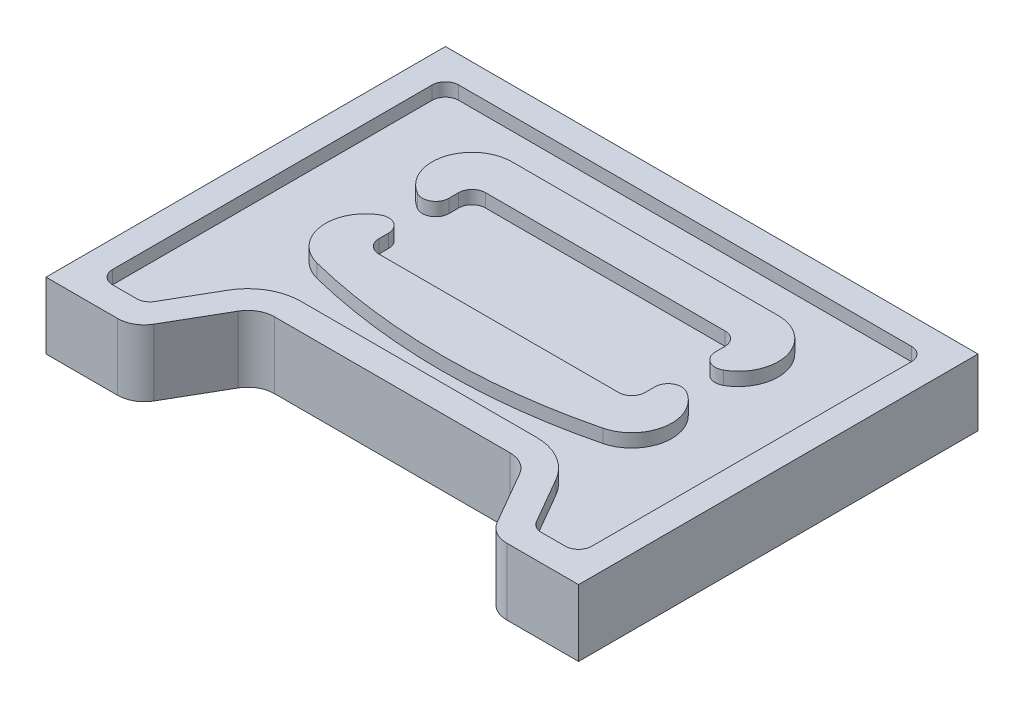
ISO-10303-21;
HEADER;
FILE_DESCRIPTION(('STEP AP214'),'2;1');
FILE_NAME('part.step','',(''),(''),'','','');
FILE_SCHEMA(('AUTOMOTIVE_DESIGN { 1 0 10303 214 1 1 1 1 }'));
ENDSEC;
DATA;
#1=APPLICATION_CONTEXT('core data for automotive mechanical design processes');
#2=APPLICATION_PROTOCOL_DEFINITION('international standard','automotive_design',2000,#1);
#3=PRODUCT_CONTEXT('',#1,'mechanical');
#4=PRODUCT('Part','Part','',(#3));
#5=PRODUCT_RELATED_PRODUCT_CATEGORY('part','',(#4));
#6=PRODUCT_DEFINITION_FORMATION('','',#4);
#7=PRODUCT_DEFINITION_CONTEXT('part definition',#1,'design');
#8=PRODUCT_DEFINITION('design','',#6,#7);
#9=PRODUCT_DEFINITION_SHAPE('','',#8);
#10=(LENGTH_UNIT() NAMED_UNIT(*) SI_UNIT(.MILLI.,.METRE.));
#11=(NAMED_UNIT(*) PLANE_ANGLE_UNIT() SI_UNIT($,.RADIAN.));
#12=(NAMED_UNIT(*) SI_UNIT($,.STERADIAN.) SOLID_ANGLE_UNIT());
#13=UNCERTAINTY_MEASURE_WITH_UNIT(LENGTH_MEASURE(1.E-05),#10,'distance_accuracy_value','');
#14=(GEOMETRIC_REPRESENTATION_CONTEXT(3) GLOBAL_UNCERTAINTY_ASSIGNED_CONTEXT((#13)) GLOBAL_UNIT_ASSIGNED_CONTEXT((#10,
#11,#12)) REPRESENTATION_CONTEXT('',''));
#15=CARTESIAN_POINT('',(0.,0.,0.));
#16=DIRECTION('',(0.,0.,1.));
#17=DIRECTION('',(1.,0.,0.));
#18=AXIS2_PLACEMENT_3D('',#15,#16,#17);
#19=CARTESIAN_POINT('',(75.9807621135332,20.,60.));
#20=DIRECTION('',(0.,1.,0.));
#21=DIRECTION('',(0.,0.,1.));
#22=AXIS2_PLACEMENT_3D('',#19,#20,#21);
#23=PLANE('',#22);
#24=DIRECTION('',(-1.,0.,0.));
#25=VECTOR('',#24,1.);
#26=CARTESIAN_POINT('',(-50.,20.,5.00000000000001));
#27=LINE('',#26,#25);
#28=CARTESIAN_POINT('',(45.,20.,5.));
#29=VERTEX_POINT('',#28);
#30=CARTESIAN_POINT('',(-45.,20.,5.00000000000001));
#31=VERTEX_POINT('',#30);
#32=EDGE_CURVE('E442',#29,#31,#27,.T.);
#33=ORIENTED_EDGE('',*,*,#32,.F.);
#34=CARTESIAN_POINT('',(45.,20.,0.));
#35=DIRECTION('',(0.,1.,0.));
#36=DIRECTION('',(0.,0.,1.));
#37=AXIS2_PLACEMENT_3D('',#34,#35,#36);
#38=CIRCLE('',#37,5.);
#39=CARTESIAN_POINT('',(50.,20.,0.));
#40=VERTEX_POINT('',#39);
#41=EDGE_CURVE('E751',#29,#40,#38,.T.);
#42=ORIENTED_EDGE('',*,*,#41,.T.);
#43=DIRECTION('',(0.,0.,1.));
#44=VECTOR('',#43,1.);
#45=CARTESIAN_POINT('',(50.,20.,5.));
#46=LINE('',#45,#44);
#47=CARTESIAN_POINT('',(50.,20.,-3.66025403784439));
#48=VERTEX_POINT('',#47);
#49=EDGE_CURVE('E439',#48,#40,#46,.T.);
#50=ORIENTED_EDGE('',*,*,#49,.F.);
#51=CARTESIAN_POINT('',(55.,20.,-3.66025403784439));
#52=DIRECTION('',(0.,1.,0.));
#53=DIRECTION('',(0.,0.,-1.));
#54=AXIS2_PLACEMENT_3D('',#51,#52,#53);
#55=CIRCLE('',#54,5.);
#56=CARTESIAN_POINT('',(57.5,20.,-7.99038105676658));
#57=VERTEX_POINT('',#56);
#58=EDGE_CURVE('E437',#57,#48,#55,.T.);
#59=ORIENTED_EDGE('',*,*,#58,.F.);
#60=CARTESIAN_POINT('',(50.,20.,5.));
#61=DIRECTION('',(0.,1.,0.));
#62=DIRECTION('',(0.,0.,1.));
#63=AXIS2_PLACEMENT_3D('',#60,#61,#62);
#64=CIRCLE('',#63,15.);
#65=CARTESIAN_POINT('',(53.636153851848,20.,19.5526075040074));
#66=VERTEX_POINT('',#65);
#67=EDGE_CURVE('E435',#66,#57,#64,.T.);
#68=ORIENTED_EDGE('',*,*,#67,.F.);
#69=CARTESIAN_POINT('',(0.,20.,-195.10989766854));
#70=DIRECTION('',(0.,1.,0.));
#71=DIRECTION('',(0.,0.,-1.));
#72=AXIS2_PLACEMENT_3D('',#69,#70,#71);
#73=CIRCLE('',#72,221.261899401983);
#74=CARTESIAN_POINT('',(-53.636153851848,20.,19.5526075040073));
#75=VERTEX_POINT('',#74);
#76=EDGE_CURVE('E408',#75,#66,#73,.T.);
#77=ORIENTED_EDGE('',*,*,#76,.F.);
#78=CARTESIAN_POINT('',(-50.,20.,5.00000000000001));
#79=DIRECTION('',(0.,1.,0.));
#80=DIRECTION('',(0.,0.,1.));
#81=AXIS2_PLACEMENT_3D('',#78,#79,#80);
#82=CIRCLE('',#81,15.);
#83=CARTESIAN_POINT('',(-57.5,20.,-7.99038105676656));
#84=VERTEX_POINT('',#83);
#85=EDGE_CURVE('E416',#84,#75,#82,.T.);
#86=ORIENTED_EDGE('',*,*,#85,.F.);
#87=CARTESIAN_POINT('',(-55.,20.,-3.66025403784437));
#88=DIRECTION('',(0.,1.,0.));
#89=DIRECTION('',(0.,0.,1.));
#90=AXIS2_PLACEMENT_3D('',#87,#88,#89);
#91=CIRCLE('',#90,5.);
#92=CARTESIAN_POINT('',(-50.,20.,-3.66025403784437));
#93=VERTEX_POINT('',#92);
#94=EDGE_CURVE('E447',#93,#84,#91,.T.);
#95=ORIENTED_EDGE('',*,*,#94,.F.);
#96=DIRECTION('',(0.,0.,-1.));
#97=VECTOR('',#96,1.);
#98=CARTESIAN_POINT('',(-50.,20.,5.00000000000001));
#99=LINE('',#98,#97);
#100=CARTESIAN_POINT('',(-50.,20.,0.));
#101=VERTEX_POINT('',#100);
#102=EDGE_CURVE('E445',#101,#93,#99,.T.);
#103=ORIENTED_EDGE('',*,*,#102,.F.);
#104=CARTESIAN_POINT('',(-45.,20.,0.));
#105=DIRECTION('',(0.,1.,0.));
#106=DIRECTION('',(0.,0.,1.));
#107=AXIS2_PLACEMENT_3D('',#104,#105,#106);
#108=CIRCLE('',#107,5.);
#109=EDGE_CURVE('E749',#101,#31,#108,.T.);
#110=ORIENTED_EDGE('',*,*,#109,.T.);
#111=EDGE_LOOP('',(#33,#42,#50,#59,#68,#77,#86,#95,#103,#110));
#112=FACE_BOUND('',#111,.T.);
#113=CARTESIAN_POINT('',(75.9807621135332,20.,60.));
#114=DIRECTION('',(0.,1.,0.));
#115=DIRECTION('',(0.,0.,1.));
#116=AXIS2_PLACEMENT_3D('',#113,#114,#115);
#117=CIRCLE('',#116,5.);
#118=CARTESIAN_POINT('',(71.650635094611,20.,62.5));
#119=VERTEX_POINT('',#118);
#120=CARTESIAN_POINT('',(75.9807621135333,20.,65.));
#121=VERTEX_POINT('',#120);
#122=EDGE_CURVE('E519',#119,#121,#117,.T.);
#123=ORIENTED_EDGE('',*,*,#122,.T.);
#124=DIRECTION('',(1.,0.,0.));
#125=VECTOR('',#124,1.);
#126=CARTESIAN_POINT('',(75.9807621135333,20.,65.));
#127=LINE('',#126,#125);
#128=CARTESIAN_POINT('',(85.,20.,65.));
#129=VERTEX_POINT('',#128);
#130=EDGE_CURVE('E522',#121,#129,#127,.T.);
#131=ORIENTED_EDGE('',*,*,#130,.T.);
#132=CARTESIAN_POINT('',(85.0000000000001,20.,60.));
#133=DIRECTION('',(0.,1.,0.));
#134=DIRECTION('',(0.,0.,-1.));
#135=AXIS2_PLACEMENT_3D('',#132,#133,#134);
#136=CIRCLE('',#135,5.);
#137=CARTESIAN_POINT('',(90.0000000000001,20.,60.));
#138=VERTEX_POINT('',#137);
#139=EDGE_CURVE('E526',#129,#138,#136,.T.);
#140=ORIENTED_EDGE('',*,*,#139,.T.);
#141=DIRECTION('',(0.,0.,-1.));
#142=VECTOR('',#141,1.);
#143=CARTESIAN_POINT('',(90.0000000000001,20.,60.));
#144=LINE('',#143,#142);
#145=CARTESIAN_POINT('',(90.0000000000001,20.,-60.));
#146=VERTEX_POINT('',#145);
#147=EDGE_CURVE('E529',#138,#146,#144,.T.);
#148=ORIENTED_EDGE('',*,*,#147,.T.);
#149=CARTESIAN_POINT('',(85.0000000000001,20.,-60.));
#150=DIRECTION('',(0.,1.,0.));
#151=DIRECTION('',(0.,0.,1.));
#152=AXIS2_PLACEMENT_3D('',#149,#150,#151);
#153=CIRCLE('',#152,5.);
#154=CARTESIAN_POINT('',(85.,20.,-65.));
#155=VERTEX_POINT('',#154);
#156=EDGE_CURVE('E532',#146,#155,#153,.T.);
#157=ORIENTED_EDGE('',*,*,#156,.T.);
#158=DIRECTION('',(-1.,0.,0.));
#159=VECTOR('',#158,1.);
#160=CARTESIAN_POINT('',(85.,20.,-65.));
#161=LINE('',#160,#159);
#162=CARTESIAN_POINT('',(-84.9999999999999,20.,-65.));
#163=VERTEX_POINT('',#162);
#164=EDGE_CURVE('E535',#155,#163,#161,.T.);
#165=ORIENTED_EDGE('',*,*,#164,.T.);
#166=CARTESIAN_POINT('',(-85.,20.,-60.));
#167=DIRECTION('',(0.,1.,0.));
#168=DIRECTION('',(0.,0.,1.));
#169=AXIS2_PLACEMENT_3D('',#166,#167,#168);
#170=CIRCLE('',#169,5.);
#171=CARTESIAN_POINT('',(-90.,20.,-60.));
#172=VERTEX_POINT('',#171);
#173=EDGE_CURVE('E538',#163,#172,#170,.T.);
#174=ORIENTED_EDGE('',*,*,#173,.T.);
#175=DIRECTION('',(0.,0.,1.));
#176=VECTOR('',#175,1.);
#177=CARTESIAN_POINT('',(-90.,20.,-60.));
#178=LINE('',#177,#176);
#179=CARTESIAN_POINT('',(-90.,20.,60.));
#180=VERTEX_POINT('',#179);
#181=EDGE_CURVE('E541',#172,#180,#178,.T.);
#182=ORIENTED_EDGE('',*,*,#181,.T.);
#183=CARTESIAN_POINT('',(-85.,20.,60.));
#184=DIRECTION('',(0.,1.,0.));
#185=DIRECTION('',(0.,0.,1.));
#186=AXIS2_PLACEMENT_3D('',#183,#184,#185);
#187=CIRCLE('',#186,5.);
#188=CARTESIAN_POINT('',(-84.9999999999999,20.,65.));
#189=VERTEX_POINT('',#188);
#190=EDGE_CURVE('E544',#180,#189,#187,.T.);
#191=ORIENTED_EDGE('',*,*,#190,.T.);
#192=DIRECTION('',(1.,0.,0.));
#193=VECTOR('',#192,1.);
#194=CARTESIAN_POINT('',(-84.9999999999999,20.,65.));
#195=LINE('',#194,#193);
#196=CARTESIAN_POINT('',(-75.980762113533,20.,65.));
#197=VERTEX_POINT('',#196);
#198=EDGE_CURVE('E547',#189,#197,#195,.T.);
#199=ORIENTED_EDGE('',*,*,#198,.T.);
#200=CARTESIAN_POINT('',(-75.980762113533,20.,60.));
#201=DIRECTION('',(0.,1.,0.));
#202=DIRECTION('',(0.,0.,1.));
#203=AXIS2_PLACEMENT_3D('',#200,#201,#202);
#204=CIRCLE('',#203,5.);
#205=CARTESIAN_POINT('',(-71.6506350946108,20.,62.5));
#206=VERTEX_POINT('',#205);
#207=EDGE_CURVE('E550',#197,#206,#204,.T.);
#208=ORIENTED_EDGE('',*,*,#207,.T.);
#209=DIRECTION('',(0.5,0.,-0.866025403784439));
#210=VECTOR('',#209,1.);
#211=CARTESIAN_POINT('',(-71.6506350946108,20.,62.5));
#212=LINE('',#211,#210);
#213=CARTESIAN_POINT('',(-61.5470053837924,20.,45.));
#214=VERTEX_POINT('',#213);
#215=EDGE_CURVE('E553',#206,#214,#212,.T.);
#216=ORIENTED_EDGE('',*,*,#215,.T.);
#217=CARTESIAN_POINT('',(-44.2264973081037,20.,55.));
#218=DIRECTION('',(0.,-1.,0.));
#219=DIRECTION('',(0.,0.,1.));
#220=AXIS2_PLACEMENT_3D('',#217,#218,#219);
#221=CIRCLE('',#220,19.9999999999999);
#222=CARTESIAN_POINT('',(-44.2264973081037,20.,35.));
#223=VERTEX_POINT('',#222);
#224=EDGE_CURVE('E556',#214,#223,#221,.T.);
#225=ORIENTED_EDGE('',*,*,#224,.T.);
#226=DIRECTION('',(1.,0.,0.));
#227=VECTOR('',#226,1.);
#228=CARTESIAN_POINT('',(-44.2264973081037,20.,35.));
#229=LINE('',#228,#227);
#230=CARTESIAN_POINT('',(44.2264973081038,20.,35.));
#231=VERTEX_POINT('',#230);
#232=EDGE_CURVE('E559',#223,#231,#229,.T.);
#233=ORIENTED_EDGE('',*,*,#232,.T.);
#234=CARTESIAN_POINT('',(44.2264973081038,20.,55.));
#235=DIRECTION('',(0.,-1.,0.));
#236=DIRECTION('',(0.,0.,1.));
#237=AXIS2_PLACEMENT_3D('',#234,#235,#236);
#238=CIRCLE('',#237,20.);
#239=CARTESIAN_POINT('',(61.5470053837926,20.,45.));
#240=VERTEX_POINT('',#239);
#241=EDGE_CURVE('E562',#231,#240,#238,.T.);
#242=ORIENTED_EDGE('',*,*,#241,.T.);
#243=DIRECTION('',(0.5,0.,0.866025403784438));
#244=VECTOR('',#243,1.);
#245=CARTESIAN_POINT('',(61.5470053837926,20.,45.));
#246=LINE('',#245,#244);
#247=EDGE_CURVE('E565',#240,#119,#246,.T.);
#248=ORIENTED_EDGE('',*,*,#247,.T.);
#249=EDGE_LOOP('',(#123,#131,#140,#148,#157,#165,#174,#182,#191,#199,#208,#216,#225,#233,#242,#248));
#250=FACE_BOUND('',#249,.T.);
#251=DIRECTION('',(1.,0.,0.));
#252=VECTOR('',#251,1.);
#253=CARTESIAN_POINT('',(-50.,20.,-35.));
#254=LINE('',#253,#252);
#255=CARTESIAN_POINT('',(-45.,20.,-35.));
#256=VERTEX_POINT('',#255);
#257=CARTESIAN_POINT('',(45.,20.,-35.));
#258=VERTEX_POINT('',#257);
#259=EDGE_CURVE('E492',#256,#258,#254,.T.);
#260=ORIENTED_EDGE('',*,*,#259,.F.);
#261=CARTESIAN_POINT('',(-45.,20.,-30.));
#262=DIRECTION('',(0.,1.,0.));
#263=DIRECTION('',(0.,0.,1.));
#264=AXIS2_PLACEMENT_3D('',#261,#262,#263);
#265=CIRCLE('',#264,5.);
#266=CARTESIAN_POINT('',(-50.,20.,-30.));
#267=VERTEX_POINT('',#266);
#268=EDGE_CURVE('E747',#256,#267,#265,.T.);
#269=ORIENTED_EDGE('',*,*,#268,.T.);
#270=DIRECTION('',(0.,0.,-1.));
#271=VECTOR('',#270,1.);
#272=CARTESIAN_POINT('',(-50.,20.,-26.3397459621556));
#273=LINE('',#272,#271);
#274=CARTESIAN_POINT('',(-50.,20.,-26.3397459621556));
#275=VERTEX_POINT('',#274);
#276=EDGE_CURVE('E490',#275,#267,#273,.T.);
#277=ORIENTED_EDGE('',*,*,#276,.F.);
#278=CARTESIAN_POINT('',(-55.,20.,-26.3397459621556));
#279=DIRECTION('',(0.,1.,0.));
#280=DIRECTION('',(0.,0.,-1.));
#281=AXIS2_PLACEMENT_3D('',#278,#279,#280);
#282=CIRCLE('',#281,5.);
#283=CARTESIAN_POINT('',(-57.5,20.,-22.0096189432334));
#284=VERTEX_POINT('',#283);
#285=EDGE_CURVE('E488',#284,#275,#282,.T.);
#286=ORIENTED_EDGE('',*,*,#285,.F.);
#287=CARTESIAN_POINT('',(-50.,20.,-35.));
#288=DIRECTION('',(0.,1.,0.));
#289=DIRECTION('',(0.,0.,1.));
#290=AXIS2_PLACEMENT_3D('',#287,#288,#289);
#291=CIRCLE('',#290,15.);
#292=CARTESIAN_POINT('',(-50.,20.,-50.));
#293=VERTEX_POINT('',#292);
#294=EDGE_CURVE('E466',#293,#284,#291,.T.);
#295=ORIENTED_EDGE('',*,*,#294,.F.);
#296=DIRECTION('',(-1.,0.,0.));
#297=VECTOR('',#296,1.);
#298=CARTESIAN_POINT('',(-50.,20.,-50.));
#299=LINE('',#298,#297);
#300=CARTESIAN_POINT('',(50.,20.,-50.));
#301=VERTEX_POINT('',#300);
#302=EDGE_CURVE('E471',#301,#293,#299,.T.);
#303=ORIENTED_EDGE('',*,*,#302,.F.);
#304=CARTESIAN_POINT('',(50.,20.,-35.));
#305=DIRECTION('',(0.,1.,0.));
#306=DIRECTION('',(0.,0.,1.));
#307=AXIS2_PLACEMENT_3D('',#304,#305,#306);
#308=CIRCLE('',#307,15.);
#309=CARTESIAN_POINT('',(57.5,20.,-22.0096189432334));
#310=VERTEX_POINT('',#309);
#311=EDGE_CURVE('E499',#310,#301,#308,.T.);
#312=ORIENTED_EDGE('',*,*,#311,.F.);
#313=CARTESIAN_POINT('',(55.,20.,-26.3397459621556));
#314=DIRECTION('',(0.,1.,0.));
#315=DIRECTION('',(0.,0.,1.));
#316=AXIS2_PLACEMENT_3D('',#313,#314,#315);
#317=CIRCLE('',#316,5.);
#318=CARTESIAN_POINT('',(50.,20.,-26.3397459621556));
#319=VERTEX_POINT('',#318);
#320=EDGE_CURVE('E497',#319,#310,#317,.T.);
#321=ORIENTED_EDGE('',*,*,#320,.F.);
#322=DIRECTION('',(0.,0.,1.));
#323=VECTOR('',#322,1.);
#324=CARTESIAN_POINT('',(50.,20.,-26.3397459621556));
#325=LINE('',#324,#323);
#326=CARTESIAN_POINT('',(50.,20.,-30.));
#327=VERTEX_POINT('',#326);
#328=EDGE_CURVE('E495',#327,#319,#325,.T.);
#329=ORIENTED_EDGE('',*,*,#328,.F.);
#330=CARTESIAN_POINT('',(45.,20.,-30.));
#331=DIRECTION('',(0.,1.,0.));
#332=DIRECTION('',(0.,0.,1.));
#333=AXIS2_PLACEMENT_3D('',#330,#331,#332);
#334=CIRCLE('',#333,5.);
#335=EDGE_CURVE('E745',#327,#258,#334,.T.);
#336=ORIENTED_EDGE('',*,*,#335,.T.);
#337=EDGE_LOOP('',(#260,#269,#277,#286,#295,#303,#312,#321,#329,#336));
#338=FACE_BOUND('',#337,.T.);
#339=ADVANCED_FACE('F39',(#112,#250,#338),#23,.T.);
#340=CARTESIAN_POINT('',(100.,25.,75.));
#341=DIRECTION('',(-1.,0.,0.));
#342=DIRECTION('',(0.,0.,1.));
#343=AXIS2_PLACEMENT_3D('',#340,#341,#342);
#344=PLANE('',#343);
#345=DIRECTION('',(0.,0.,-1.));
#346=VECTOR('',#345,1.);
#347=CARTESIAN_POINT('',(100.,0.,75.));
#348=LINE('',#347,#346);
#349=CARTESIAN_POINT('',(100.,0.,75.));
#350=VERTEX_POINT('',#349);
#351=CARTESIAN_POINT('',(100.,0.,-75.));
#352=VERTEX_POINT('',#351);
#353=EDGE_CURVE('E616',#350,#352,#348,.T.);
#354=ORIENTED_EDGE('',*,*,#353,.T.);
#355=DIRECTION('',(0.,-1.,0.));
#356=VECTOR('',#355,1.);
#357=CARTESIAN_POINT('',(100.,25.,-75.));
#358=LINE('',#357,#356);
#359=CARTESIAN_POINT('',(100.,25.,-75.));
#360=VERTEX_POINT('',#359);
#361=EDGE_CURVE('E737',#360,#352,#358,.T.);
#362=ORIENTED_EDGE('',*,*,#361,.F.);
#363=DIRECTION('',(0.,0.,-1.));
#364=VECTOR('',#363,1.);
#365=CARTESIAN_POINT('',(100.,25.,75.));
#366=LINE('',#365,#364);
#367=CARTESIAN_POINT('',(100.,25.,75.));
#368=VERTEX_POINT('',#367);
#369=EDGE_CURVE('E647',#368,#360,#366,.T.);
#370=ORIENTED_EDGE('',*,*,#369,.F.);
#371=DIRECTION('',(0.,-1.,0.));
#372=VECTOR('',#371,1.);
#373=CARTESIAN_POINT('',(100.,25.,75.));
#374=LINE('',#373,#372);
#375=EDGE_CURVE('E702',#368,#350,#374,.T.);
#376=ORIENTED_EDGE('',*,*,#375,.T.);
#377=EDGE_LOOP('',(#354,#362,#370,#376));
#378=FACE_BOUND('',#377,.T.);
#379=ADVANCED_FACE('F819',(#378),#344,.F.);
#380=CARTESIAN_POINT('',(-99.9999999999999,25.,-75.));
#381=DIRECTION('',(0.,0.,1.));
#382=DIRECTION('',(1.,0.,0.));
#383=AXIS2_PLACEMENT_3D('',#380,#381,#382);
#384=PLANE('',#383);
#385=DIRECTION('',(-1.,0.,0.));
#386=VECTOR('',#385,1.);
#387=CARTESIAN_POINT('',(62.5000000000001,4.49999999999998,-75.));
#388=LINE('',#387,#386);
#389=CARTESIAN_POINT('',(62.5000000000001,4.49999999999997,-75.));
#390=VERTEX_POINT('',#389);
#391=CARTESIAN_POINT('',(-62.4999999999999,4.5,-75.));
#392=VERTEX_POINT('',#391);
#393=EDGE_CURVE('E402',#390,#392,#388,.T.);
#394=ORIENTED_EDGE('',*,*,#393,.F.);
#395=CARTESIAN_POINT('',(62.5000000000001,12.5,-75.));
#396=DIRECTION('',(0.,0.,-1.));
#397=DIRECTION('',(-1.,0.,0.));
#398=AXIS2_PLACEMENT_3D('',#395,#396,#397);
#399=CIRCLE('',#398,8.00000000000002);
#400=CARTESIAN_POINT('',(62.5000000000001,20.5,-75.));
#401=VERTEX_POINT('',#400);
#402=EDGE_CURVE('E376',#401,#390,#399,.T.);
#403=ORIENTED_EDGE('',*,*,#402,.F.);
#404=DIRECTION('',(1.,0.,0.));
#405=VECTOR('',#404,1.);
#406=CARTESIAN_POINT('',(62.5000000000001,20.5,-75.));
#407=LINE('',#406,#405);
#408=CARTESIAN_POINT('',(-62.4999999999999,20.5,-75.));
#409=VERTEX_POINT('',#408);
#410=EDGE_CURVE('E393',#409,#401,#407,.T.);
#411=ORIENTED_EDGE('',*,*,#410,.F.);
#412=CARTESIAN_POINT('',(-62.4999999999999,12.5,-75.));
#413=DIRECTION('',(0.,0.,-1.));
#414=DIRECTION('',(-1.,0.,0.));
#415=AXIS2_PLACEMENT_3D('',#412,#413,#414);
#416=CIRCLE('',#415,8.00000000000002);
#417=EDGE_CURVE('E396',#392,#409,#416,.T.);
#418=ORIENTED_EDGE('',*,*,#417,.F.);
#419=EDGE_LOOP('',(#394,#403,#411,#418));
#420=FACE_BOUND('',#419,.T.);
#421=DIRECTION('',(-1.,0.,0.));
#422=VECTOR('',#421,1.);
#423=CARTESIAN_POINT('',(-99.9999999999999,0.,-75.));
#424=LINE('',#423,#422);
#425=CARTESIAN_POINT('',(-99.9999999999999,0.,-75.));
#426=VERTEX_POINT('',#425);
#427=EDGE_CURVE('E1480',#352,#426,#424,.T.);
#428=ORIENTED_EDGE('',*,*,#427,.T.);
#429=DIRECTION('',(0.,-1.,0.));
#430=VECTOR('',#429,1.);
#431=CARTESIAN_POINT('',(-99.9999999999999,25.,-75.));
#432=LINE('',#431,#430);
#433=CARTESIAN_POINT('',(-99.9999999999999,25.,-75.));
#434=VERTEX_POINT('',#433);
#435=EDGE_CURVE('E734',#434,#426,#432,.T.);
#436=ORIENTED_EDGE('',*,*,#435,.F.);
#437=DIRECTION('',(-1.,0.,0.));
#438=VECTOR('',#437,1.);
#439=CARTESIAN_POINT('',(-99.9999999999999,25.,-75.));
#440=LINE('',#439,#438);
#441=EDGE_CURVE('E650',#360,#434,#440,.T.);
#442=ORIENTED_EDGE('',*,*,#441,.F.);
#443=ORIENTED_EDGE('',*,*,#361,.T.);
#444=EDGE_LOOP('',(#428,#436,#442,#443));
#445=FACE_BOUND('',#444,.T.);
#446=ADVANCED_FACE('F825',(#420,#445),#384,.F.);
#447=CARTESIAN_POINT('',(-99.9999999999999,25.,75.));
#448=DIRECTION('',(1.,0.,0.));
#449=DIRECTION('',(0.,0.,-1.));
#450=AXIS2_PLACEMENT_3D('',#447,#448,#449);
#451=PLANE('',#450);
#452=DIRECTION('',(0.,0.,1.));
#453=VECTOR('',#452,1.);
#454=CARTESIAN_POINT('',(-99.9999999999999,0.,75.));
#455=LINE('',#454,#453);
#456=CARTESIAN_POINT('',(-99.9999999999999,0.,75.));
#457=VERTEX_POINT('',#456);
#458=EDGE_CURVE('E1481',#426,#457,#455,.T.);
#459=ORIENTED_EDGE('',*,*,#458,.T.);
#460=DIRECTION('',(0.,-1.,0.));
#461=VECTOR('',#460,1.);
#462=CARTESIAN_POINT('',(-99.9999999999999,25.,75.));
#463=LINE('',#462,#461);
#464=CARTESIAN_POINT('',(-99.9999999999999,25.,75.));
#465=VERTEX_POINT('',#464);
#466=EDGE_CURVE('E729',#465,#457,#463,.T.);
#467=ORIENTED_EDGE('',*,*,#466,.F.);
#468=DIRECTION('',(0.,0.,1.));
#469=VECTOR('',#468,1.);
#470=CARTESIAN_POINT('',(-99.9999999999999,25.,75.));
#471=LINE('',#470,#469);
#472=EDGE_CURVE('E653',#434,#465,#471,.T.);
#473=ORIENTED_EDGE('',*,*,#472,.F.);
#474=ORIENTED_EDGE('',*,*,#435,.T.);
#475=EDGE_LOOP('',(#459,#467,#473,#474));
#476=FACE_BOUND('',#475,.T.);
#477=ADVANCED_FACE('F940',(#476),#451,.F.);
#478=CARTESIAN_POINT('',(-99.9999999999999,25.,75.));
#479=DIRECTION('',(0.,0.,-1.));
#480=DIRECTION('',(-1.,0.,0.));
#481=AXIS2_PLACEMENT_3D('',#478,#479,#480);
#482=PLANE('',#481);
#483=DIRECTION('',(1.,0.,0.));
#484=VECTOR('',#483,1.);
#485=CARTESIAN_POINT('',(-99.9999999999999,0.,75.));
#486=LINE('',#485,#484);
#487=CARTESIAN_POINT('',(-73.0940107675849,0.,75.));
#488=VERTEX_POINT('',#487);
#489=EDGE_CURVE('E677',#457,#488,#486,.T.);
#490=ORIENTED_EDGE('',*,*,#489,.T.);
#491=DIRECTION('',(0.,-1.,0.));
#492=VECTOR('',#491,1.);
#493=CARTESIAN_POINT('',(-73.0940107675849,25.,75.));
#494=LINE('',#493,#492);
#495=CARTESIAN_POINT('',(-73.0940107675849,25.,75.));
#496=VERTEX_POINT('',#495);
#497=EDGE_CURVE('E727',#496,#488,#494,.T.);
#498=ORIENTED_EDGE('',*,*,#497,.F.);
#499=DIRECTION('',(1.,0.,0.));
#500=VECTOR('',#499,1.);
#501=CARTESIAN_POINT('',(-99.9999999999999,25.,75.));
#502=LINE('',#501,#500);
#503=EDGE_CURVE('E655',#465,#496,#502,.T.);
#504=ORIENTED_EDGE('',*,*,#503,.F.);
#505=ORIENTED_EDGE('',*,*,#466,.T.);
#506=EDGE_LOOP('',(#490,#498,#504,#505));
#507=FACE_BOUND('',#506,.T.);
#508=ADVANCED_FACE('F936',(#507),#482,.F.);
#509=CARTESIAN_POINT('',(-73.0940107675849,25.,65.));
#510=DIRECTION('',(0.,-1.,0.));
#511=DIRECTION('',(0.,0.,-1.));
#512=AXIS2_PLACEMENT_3D('',#509,#510,#511);
#513=CYLINDRICAL_SURFACE('',#512,10.);
#514=CARTESIAN_POINT('',(-73.0940107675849,0.,65.));
#515=DIRECTION('',(0.,1.,0.));
#516=DIRECTION('',(0.,0.,1.));
#517=AXIS2_PLACEMENT_3D('',#514,#515,#516);
#518=CIRCLE('',#517,10.);
#519=CARTESIAN_POINT('',(-64.4337567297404,0.,69.9999999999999));
#520=VERTEX_POINT('',#519);
#521=EDGE_CURVE('E671',#488,#520,#518,.T.);
#522=ORIENTED_EDGE('',*,*,#521,.T.);
#523=DIRECTION('',(0.,-1.,0.));
#524=VECTOR('',#523,1.);
#525=CARTESIAN_POINT('',(-64.4337567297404,25.,69.9999999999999));
#526=LINE('',#525,#524);
#527=CARTESIAN_POINT('',(-64.4337567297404,25.,69.9999999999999));
#528=VERTEX_POINT('',#527);
#529=EDGE_CURVE('E724',#528,#520,#526,.T.);
#530=ORIENTED_EDGE('',*,*,#529,.F.);
#531=CARTESIAN_POINT('',(-73.0940107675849,25.,65.));
#532=DIRECTION('',(0.,1.,0.));
#533=DIRECTION('',(0.,0.,1.));
#534=AXIS2_PLACEMENT_3D('',#531,#532,#533);
#535=CIRCLE('',#534,10.);
#536=EDGE_CURVE('E657',#496,#528,#535,.T.);
#537=ORIENTED_EDGE('',*,*,#536,.F.);
#538=ORIENTED_EDGE('',*,*,#497,.T.);
#539=EDGE_LOOP('',(#522,#530,#537,#538));
#540=FACE_BOUND('',#539,.T.);
#541=ADVANCED_FACE('F932',(#540),#513,.T.);
#542=CARTESIAN_POINT('',(-64.4337567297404,25.,69.9999999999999));
#543=DIRECTION('',(-0.866025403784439,0.,-0.5));
#544=DIRECTION('',(-0.5,0.,0.866025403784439));
#545=AXIS2_PLACEMENT_3D('',#542,#543,#544);
#546=PLANE('',#545);
#547=DIRECTION('',(0.5,0.,-0.866025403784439));
#548=VECTOR('',#547,1.);
#549=CARTESIAN_POINT('',(-64.4337567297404,0.,69.9999999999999));
#550=LINE('',#549,#548);
#551=CARTESIAN_POINT('',(-52.886751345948,0.,50.));
#552=VERTEX_POINT('',#551);
#553=EDGE_CURVE('E676',#520,#552,#550,.T.);
#554=ORIENTED_EDGE('',*,*,#553,.T.);
#555=DIRECTION('',(0.,-1.,0.));
#556=VECTOR('',#555,1.);
#557=CARTESIAN_POINT('',(-52.886751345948,25.,50.));
#558=LINE('',#557,#556);
#559=CARTESIAN_POINT('',(-52.886751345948,25.,50.));
#560=VERTEX_POINT('',#559);
#561=EDGE_CURVE('E721',#560,#552,#558,.T.);
#562=ORIENTED_EDGE('',*,*,#561,.F.);
#563=DIRECTION('',(0.5,0.,-0.866025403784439));
#564=VECTOR('',#563,1.);
#565=CARTESIAN_POINT('',(-64.4337567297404,25.,69.9999999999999));
#566=LINE('',#565,#564);
#567=EDGE_CURVE('E661',#528,#560,#566,.T.);
#568=ORIENTED_EDGE('',*,*,#567,.F.);
#569=ORIENTED_EDGE('',*,*,#529,.T.);
#570=EDGE_LOOP('',(#554,#562,#568,#569));
#571=FACE_BOUND('',#570,.T.);
#572=ADVANCED_FACE('F928',(#571),#546,.F.);
#573=CARTESIAN_POINT('',(-44.2264973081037,25.,55.));
#574=DIRECTION('',(0.,-1.,0.));
#575=DIRECTION('',(0.,0.,-1.));
#576=AXIS2_PLACEMENT_3D('',#573,#574,#575);
#577=CYLINDRICAL_SURFACE('',#576,9.99999999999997);
#578=CARTESIAN_POINT('',(-44.2264973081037,0.,55.));
#579=DIRECTION('',(0.,-1.,0.));
#580=DIRECTION('',(0.,0.,-1.));
#581=AXIS2_PLACEMENT_3D('',#578,#579,#580);
#582=CIRCLE('',#581,9.99999999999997);
#583=CARTESIAN_POINT('',(-44.2264973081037,0.,45.));
#584=VERTEX_POINT('',#583);
#585=EDGE_CURVE('E681',#552,#584,#582,.T.);
#586=ORIENTED_EDGE('',*,*,#585,.T.);
#587=DIRECTION('',(0.,-1.,0.));
#588=VECTOR('',#587,1.);
#589=CARTESIAN_POINT('',(-44.2264973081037,25.,45.));
#590=LINE('',#589,#588);
#591=CARTESIAN_POINT('',(-44.2264973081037,25.,45.));
#592=VERTEX_POINT('',#591);
#593=EDGE_CURVE('E718',#592,#584,#590,.T.);
#594=ORIENTED_EDGE('',*,*,#593,.F.);
#595=CARTESIAN_POINT('',(-44.2264973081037,25.,55.));
#596=DIRECTION('',(0.,-1.,0.));
#597=DIRECTION('',(0.,0.,-1.));
#598=AXIS2_PLACEMENT_3D('',#595,#596,#597);
#599=CIRCLE('',#598,9.99999999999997);
#600=EDGE_CURVE('E1491',#560,#592,#599,.T.);
#601=ORIENTED_EDGE('',*,*,#600,.F.);
#602=ORIENTED_EDGE('',*,*,#561,.T.);
#603=EDGE_LOOP('',(#586,#594,#601,#602));
#604=FACE_BOUND('',#603,.T.);
#605=ADVANCED_FACE('F924',(#604),#577,.F.);
#606=CARTESIAN_POINT('',(-44.2264973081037,25.,45.));
#607=DIRECTION('',(0.,0.,-1.));
#608=DIRECTION('',(-1.,0.,0.));
#609=AXIS2_PLACEMENT_3D('',#606,#607,#608);
#610=PLANE('',#609);
#611=DIRECTION('',(1.,0.,0.));
#612=VECTOR('',#611,1.);
#613=CARTESIAN_POINT('',(-44.2264973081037,0.,45.));
#614=LINE('',#613,#612);
#615=CARTESIAN_POINT('',(44.2264973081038,0.,45.));
#616=VERTEX_POINT('',#615);
#617=EDGE_CURVE('E687',#584,#616,#614,.T.);
#618=ORIENTED_EDGE('',*,*,#617,.T.);
#619=DIRECTION('',(0.,-1.,0.));
#620=VECTOR('',#619,1.);
#621=CARTESIAN_POINT('',(44.2264973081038,25.,45.));
#622=LINE('',#621,#620);
#623=CARTESIAN_POINT('',(44.2264973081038,25.,45.));
#624=VERTEX_POINT('',#623);
#625=EDGE_CURVE('E715',#624,#616,#622,.T.);
#626=ORIENTED_EDGE('',*,*,#625,.F.);
#627=DIRECTION('',(1.,0.,0.));
#628=VECTOR('',#627,1.);
#629=CARTESIAN_POINT('',(-44.2264973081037,25.,45.));
#630=LINE('',#629,#628);
#631=EDGE_CURVE('E1458',#592,#624,#630,.T.);
#632=ORIENTED_EDGE('',*,*,#631,.F.);
#633=ORIENTED_EDGE('',*,*,#593,.T.);
#634=EDGE_LOOP('',(#618,#626,#632,#633));
#635=FACE_BOUND('',#634,.T.);
#636=ADVANCED_FACE('F920',(#635),#610,.F.);
#637=CARTESIAN_POINT('',(44.2264973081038,25.,55.));
#638=DIRECTION('',(0.,-1.,0.));
#639=DIRECTION('',(0.,0.,-1.));
#640=AXIS2_PLACEMENT_3D('',#637,#638,#639);
#641=CYLINDRICAL_SURFACE('',#640,10.);
#642=CARTESIAN_POINT('',(44.2264973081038,0.,55.));
#643=DIRECTION('',(0.,-1.,0.));
#644=DIRECTION('',(0.,0.,-1.));
#645=AXIS2_PLACEMENT_3D('',#642,#643,#644);
#646=CIRCLE('',#645,10.);
#647=CARTESIAN_POINT('',(52.8867513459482,0.,50.));
#648=VERTEX_POINT('',#647);
#649=EDGE_CURVE('E690',#616,#648,#646,.T.);
#650=ORIENTED_EDGE('',*,*,#649,.T.);
#651=DIRECTION('',(0.,-1.,0.));
#652=VECTOR('',#651,1.);
#653=CARTESIAN_POINT('',(52.8867513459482,25.,50.));
#654=LINE('',#653,#652);
#655=CARTESIAN_POINT('',(52.8867513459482,25.,50.));
#656=VERTEX_POINT('',#655);
#657=EDGE_CURVE('E712',#656,#648,#654,.T.);
#658=ORIENTED_EDGE('',*,*,#657,.F.);
#659=CARTESIAN_POINT('',(44.2264973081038,25.,55.));
#660=DIRECTION('',(0.,-1.,0.));
#661=DIRECTION('',(0.,0.,-1.));
#662=AXIS2_PLACEMENT_3D('',#659,#660,#661);
#663=CIRCLE('',#662,10.);
#664=EDGE_CURVE('E1471',#624,#656,#663,.T.);
#665=ORIENTED_EDGE('',*,*,#664,.F.);
#666=ORIENTED_EDGE('',*,*,#625,.T.);
#667=EDGE_LOOP('',(#650,#658,#665,#666));
#668=FACE_BOUND('',#667,.T.);
#669=ADVANCED_FACE('F916',(#668),#641,.F.);
#670=CARTESIAN_POINT('',(52.8867513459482,25.,50.));
#671=DIRECTION('',(0.866025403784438,0.,-0.5));
#672=DIRECTION('',(-0.5,0.,-0.866025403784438));
#673=AXIS2_PLACEMENT_3D('',#670,#671,#672);
#674=PLANE('',#673);
#675=DIRECTION('',(0.500000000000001,0.,0.866025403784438));
#676=VECTOR('',#675,1.);
#677=CARTESIAN_POINT('',(52.8867513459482,0.,50.));
#678=LINE('',#677,#676);
#679=CARTESIAN_POINT('',(64.4337567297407,0.,70.));
#680=VERTEX_POINT('',#679);
#681=EDGE_CURVE('E694',#648,#680,#678,.T.);
#682=ORIENTED_EDGE('',*,*,#681,.T.);
#683=DIRECTION('',(0.,-1.,0.));
#684=VECTOR('',#683,1.);
#685=CARTESIAN_POINT('',(64.4337567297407,25.,70.));
#686=LINE('',#685,#684);
#687=CARTESIAN_POINT('',(64.4337567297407,25.,70.));
#688=VERTEX_POINT('',#687);
#689=EDGE_CURVE('E709',#688,#680,#686,.T.);
#690=ORIENTED_EDGE('',*,*,#689,.F.);
#691=DIRECTION('',(0.500000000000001,0.,0.866025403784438));
#692=VECTOR('',#691,1.);
#693=CARTESIAN_POINT('',(52.8867513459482,25.,50.));
#694=LINE('',#693,#692);
#695=EDGE_CURVE('E1467',#656,#688,#694,.T.);
#696=ORIENTED_EDGE('',*,*,#695,.F.);
#697=ORIENTED_EDGE('',*,*,#657,.T.);
#698=EDGE_LOOP('',(#682,#690,#696,#697));
#699=FACE_BOUND('',#698,.T.);
#700=ADVANCED_FACE('F912',(#699),#674,.F.);
#701=CARTESIAN_POINT('',(73.0940107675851,25.,65.));
#702=DIRECTION('',(0.,-1.,0.));
#703=DIRECTION('',(0.,0.,-1.));
#704=AXIS2_PLACEMENT_3D('',#701,#702,#703);
#705=CYLINDRICAL_SURFACE('',#704,10.);
#706=CARTESIAN_POINT('',(73.0940107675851,0.,65.));
#707=DIRECTION('',(0.,1.,0.));
#708=DIRECTION('',(0.,0.,1.));
#709=AXIS2_PLACEMENT_3D('',#706,#707,#708);
#710=CIRCLE('',#709,10.);
#711=CARTESIAN_POINT('',(73.0940107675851,0.,75.));
#712=VERTEX_POINT('',#711);
#713=EDGE_CURVE('E697',#680,#712,#710,.T.);
#714=ORIENTED_EDGE('',*,*,#713,.T.);
#715=DIRECTION('',(0.,-1.,0.));
#716=VECTOR('',#715,1.);
#717=CARTESIAN_POINT('',(73.0940107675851,25.,75.));
#718=LINE('',#717,#716);
#719=CARTESIAN_POINT('',(73.0940107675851,25.,75.));
#720=VERTEX_POINT('',#719);
#721=EDGE_CURVE('E705',#720,#712,#718,.T.);
#722=ORIENTED_EDGE('',*,*,#721,.F.);
#723=CARTESIAN_POINT('',(73.0940107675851,25.,65.));
#724=DIRECTION('',(0.,1.,0.));
#725=DIRECTION('',(0.,0.,1.));
#726=AXIS2_PLACEMENT_3D('',#723,#724,#725);
#727=CIRCLE('',#726,10.);
#728=EDGE_CURVE('E1470',#688,#720,#727,.T.);
#729=ORIENTED_EDGE('',*,*,#728,.F.);
#730=ORIENTED_EDGE('',*,*,#689,.T.);
#731=EDGE_LOOP('',(#714,#722,#729,#730));
#732=FACE_BOUND('',#731,.T.);
#733=ADVANCED_FACE('F908',(#732),#705,.T.);
#734=CARTESIAN_POINT('',(73.0940107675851,25.,75.));
#735=DIRECTION('',(0.,0.,-1.));
#736=DIRECTION('',(-1.,0.,0.));
#737=AXIS2_PLACEMENT_3D('',#734,#735,#736);
#738=PLANE('',#737);
#739=DIRECTION('',(1.,0.,0.));
#740=VECTOR('',#739,1.);
#741=CARTESIAN_POINT('',(73.0940107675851,0.,75.));
#742=LINE('',#741,#740);
#743=EDGE_CURVE('E651',#712,#350,#742,.T.);
#744=ORIENTED_EDGE('',*,*,#743,.T.);
#745=ORIENTED_EDGE('',*,*,#375,.F.);
#746=DIRECTION('',(1.,0.,0.));
#747=VECTOR('',#746,1.);
#748=CARTESIAN_POINT('',(73.0940107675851,25.,75.));
#749=LINE('',#748,#747);
#750=EDGE_CURVE('E706',#720,#368,#749,.T.);
#751=ORIENTED_EDGE('',*,*,#750,.F.);
#752=ORIENTED_EDGE('',*,*,#721,.T.);
#753=EDGE_LOOP('',(#744,#745,#751,#752));
#754=FACE_BOUND('',#753,.T.);
#755=ADVANCED_FACE('F901',(#754),#738,.F.);
#756=CARTESIAN_POINT('',(-73.0940107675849,25.,65.));
#757=DIRECTION('',(0.,1.,0.));
#758=DIRECTION('',(0.,0.,1.));
#759=AXIS2_PLACEMENT_3D('',#756,#757,#758);
#760=PLANE('',#759);
#761=CARTESIAN_POINT('',(75.9807621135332,25.,60.));
#762=DIRECTION('',(0.,1.,0.));
#763=DIRECTION('',(0.,0.,1.));
#764=AXIS2_PLACEMENT_3D('',#761,#762,#763);
#765=CIRCLE('',#764,5.);
#766=CARTESIAN_POINT('',(71.650635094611,25.,62.5));
#767=VERTEX_POINT('',#766);
#768=CARTESIAN_POINT('',(75.9807621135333,25.,65.));
#769=VERTEX_POINT('',#768);
#770=EDGE_CURVE('E518',#767,#769,#765,.T.);
#771=ORIENTED_EDGE('',*,*,#770,.F.);
#772=DIRECTION('',(0.5,0.,0.866025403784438));
#773=VECTOR('',#772,1.);
#774=CARTESIAN_POINT('',(61.5470053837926,25.,45.));
#775=LINE('',#774,#773);
#776=CARTESIAN_POINT('',(61.5470053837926,25.,45.));
#777=VERTEX_POINT('',#776);
#778=EDGE_CURVE('E523',#777,#767,#775,.T.);
#779=ORIENTED_EDGE('',*,*,#778,.F.);
#780=CARTESIAN_POINT('',(44.2264973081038,25.,55.));
#781=DIRECTION('',(0.,-1.,0.));
#782=DIRECTION('',(0.,0.,1.));
#783=AXIS2_PLACEMENT_3D('',#780,#781,#782);
#784=CIRCLE('',#783,20.);
#785=CARTESIAN_POINT('',(44.2264973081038,25.,35.));
#786=VERTEX_POINT('',#785);
#787=EDGE_CURVE('E609',#786,#777,#784,.T.);
#788=ORIENTED_EDGE('',*,*,#787,.F.);
#789=DIRECTION('',(1.,0.,0.));
#790=VECTOR('',#789,1.);
#791=CARTESIAN_POINT('',(-44.2264973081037,25.,35.));
#792=LINE('',#791,#790);
#793=CARTESIAN_POINT('',(-44.2264973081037,25.,35.));
#794=VERTEX_POINT('',#793);
#795=EDGE_CURVE('E606',#794,#786,#792,.T.);
#796=ORIENTED_EDGE('',*,*,#795,.F.);
#797=CARTESIAN_POINT('',(-44.2264973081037,25.,55.));
#798=DIRECTION('',(0.,-1.,0.));
#799=DIRECTION('',(0.,0.,1.));
#800=AXIS2_PLACEMENT_3D('',#797,#798,#799);
#801=CIRCLE('',#800,19.9999999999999);
#802=CARTESIAN_POINT('',(-61.5470053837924,25.,45.));
#803=VERTEX_POINT('',#802);
#804=EDGE_CURVE('E603',#803,#794,#801,.T.);
#805=ORIENTED_EDGE('',*,*,#804,.F.);
#806=DIRECTION('',(0.5,0.,-0.866025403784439));
#807=VECTOR('',#806,1.);
#808=CARTESIAN_POINT('',(-71.6506350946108,25.,62.5));
#809=LINE('',#808,#807);
#810=CARTESIAN_POINT('',(-71.6506350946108,25.,62.5));
#811=VERTEX_POINT('',#810);
#812=EDGE_CURVE('E600',#811,#803,#809,.T.);
#813=ORIENTED_EDGE('',*,*,#812,.F.);
#814=CARTESIAN_POINT('',(-75.980762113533,25.,60.));
#815=DIRECTION('',(0.,1.,0.));
#816=DIRECTION('',(0.,0.,1.));
#817=AXIS2_PLACEMENT_3D('',#814,#815,#816);
#818=CIRCLE('',#817,5.);
#819=CARTESIAN_POINT('',(-75.980762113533,25.,65.));
#820=VERTEX_POINT('',#819);
#821=EDGE_CURVE('E597',#820,#811,#818,.T.);
#822=ORIENTED_EDGE('',*,*,#821,.F.);
#823=DIRECTION('',(1.,0.,0.));
#824=VECTOR('',#823,1.);
#825=CARTESIAN_POINT('',(-84.9999999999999,25.,65.));
#826=LINE('',#825,#824);
#827=CARTESIAN_POINT('',(-84.9999999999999,25.,65.));
#828=VERTEX_POINT('',#827);
#829=EDGE_CURVE('E594',#828,#820,#826,.T.);
#830=ORIENTED_EDGE('',*,*,#829,.F.);
#831=CARTESIAN_POINT('',(-85.,25.,60.));
#832=DIRECTION('',(0.,1.,0.));
#833=DIRECTION('',(0.,0.,1.));
#834=AXIS2_PLACEMENT_3D('',#831,#832,#833);
#835=CIRCLE('',#834,5.);
#836=CARTESIAN_POINT('',(-90.,25.,60.));
#837=VERTEX_POINT('',#836);
#838=EDGE_CURVE('E591',#837,#828,#835,.T.);
#839=ORIENTED_EDGE('',*,*,#838,.F.);
#840=DIRECTION('',(0.,0.,1.));
#841=VECTOR('',#840,1.);
#842=CARTESIAN_POINT('',(-90.,25.,-60.));
#843=LINE('',#842,#841);
#844=CARTESIAN_POINT('',(-90.,25.,-60.));
#845=VERTEX_POINT('',#844);
#846=EDGE_CURVE('E588',#845,#837,#843,.T.);
#847=ORIENTED_EDGE('',*,*,#846,.F.);
#848=CARTESIAN_POINT('',(-85.,25.,-60.));
#849=DIRECTION('',(0.,1.,0.));
#850=DIRECTION('',(0.,0.,1.));
#851=AXIS2_PLACEMENT_3D('',#848,#849,#850);
#852=CIRCLE('',#851,5.);
#853=CARTESIAN_POINT('',(-84.9999999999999,25.,-65.));
#854=VERTEX_POINT('',#853);
#855=EDGE_CURVE('E585',#854,#845,#852,.T.);
#856=ORIENTED_EDGE('',*,*,#855,.F.);
#857=DIRECTION('',(-1.,0.,0.));
#858=VECTOR('',#857,1.);
#859=CARTESIAN_POINT('',(85.,25.,-65.));
#860=LINE('',#859,#858);
#861=CARTESIAN_POINT('',(85.,25.,-65.));
#862=VERTEX_POINT('',#861);
#863=EDGE_CURVE('E582',#862,#854,#860,.T.);
#864=ORIENTED_EDGE('',*,*,#863,.F.);
#865=CARTESIAN_POINT('',(85.0000000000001,25.,-60.));
#866=DIRECTION('',(0.,1.,0.));
#867=DIRECTION('',(0.,0.,1.));
#868=AXIS2_PLACEMENT_3D('',#865,#866,#867);
#869=CIRCLE('',#868,5.);
#870=CARTESIAN_POINT('',(90.0000000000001,25.,-60.));
#871=VERTEX_POINT('',#870);
#872=EDGE_CURVE('E579',#871,#862,#869,.T.);
#873=ORIENTED_EDGE('',*,*,#872,.F.);
#874=DIRECTION('',(0.,0.,-1.));
#875=VECTOR('',#874,1.);
#876=CARTESIAN_POINT('',(90.0000000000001,25.,60.));
#877=LINE('',#876,#875);
#878=CARTESIAN_POINT('',(90.0000000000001,25.,60.));
#879=VERTEX_POINT('',#878);
#880=EDGE_CURVE('E576',#879,#871,#877,.T.);
#881=ORIENTED_EDGE('',*,*,#880,.F.);
#882=CARTESIAN_POINT('',(85.0000000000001,25.,60.));
#883=DIRECTION('',(0.,1.,0.));
#884=DIRECTION('',(0.,0.,-1.));
#885=AXIS2_PLACEMENT_3D('',#882,#883,#884);
#886=CIRCLE('',#885,5.);
#887=CARTESIAN_POINT('',(85.,25.,65.));
#888=VERTEX_POINT('',#887);
#889=EDGE_CURVE('E573',#888,#879,#886,.T.);
#890=ORIENTED_EDGE('',*,*,#889,.F.);
#891=DIRECTION('',(1.,0.,0.));
#892=VECTOR('',#891,1.);
#893=CARTESIAN_POINT('',(75.9807621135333,25.,65.));
#894=LINE('',#893,#892);
#895=EDGE_CURVE('E570',#769,#888,#894,.T.);
#896=ORIENTED_EDGE('',*,*,#895,.F.);
#897=EDGE_LOOP('',(#771,#779,#788,#796,#805,#813,#822,#830,#839,#847,#856,#864,#873,#881,#890,#896));
#898=FACE_BOUND('',#897,.T.);
#899=ORIENTED_EDGE('',*,*,#369,.T.);
#900=ORIENTED_EDGE('',*,*,#441,.T.);
#901=ORIENTED_EDGE('',*,*,#472,.T.);
#902=ORIENTED_EDGE('',*,*,#503,.T.);
#903=ORIENTED_EDGE('',*,*,#536,.T.);
#904=ORIENTED_EDGE('',*,*,#567,.T.);
#905=ORIENTED_EDGE('',*,*,#600,.T.);
#906=ORIENTED_EDGE('',*,*,#631,.T.);
#907=ORIENTED_EDGE('',*,*,#664,.T.);
#908=ORIENTED_EDGE('',*,*,#695,.T.);
#909=ORIENTED_EDGE('',*,*,#728,.T.);
#910=ORIENTED_EDGE('',*,*,#750,.T.);
#911=EDGE_LOOP('',(#899,#900,#901,#902,#903,#904,#905,#906,#907,#908,#909,#910));
#912=FACE_BOUND('',#911,.T.);
#913=ADVANCED_FACE('F898',(#898,#912),#760,.T.);
#914=CARTESIAN_POINT('',(-73.0940107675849,0.,65.));
#915=DIRECTION('',(0.,1.,0.));
#916=DIRECTION('',(0.,0.,1.));
#917=AXIS2_PLACEMENT_3D('',#914,#915,#916);
#918=PLANE('',#917);
#919=ORIENTED_EDGE('',*,*,#353,.F.);
#920=ORIENTED_EDGE('',*,*,#743,.F.);
#921=ORIENTED_EDGE('',*,*,#713,.F.);
#922=ORIENTED_EDGE('',*,*,#681,.F.);
#923=ORIENTED_EDGE('',*,*,#649,.F.);
#924=ORIENTED_EDGE('',*,*,#617,.F.);
#925=ORIENTED_EDGE('',*,*,#585,.F.);
#926=ORIENTED_EDGE('',*,*,#553,.F.);
#927=ORIENTED_EDGE('',*,*,#521,.F.);
#928=ORIENTED_EDGE('',*,*,#489,.F.);
#929=ORIENTED_EDGE('',*,*,#458,.F.);
#930=ORIENTED_EDGE('',*,*,#427,.F.);
#931=EDGE_LOOP('',(#919,#920,#921,#922,#923,#924,#925,#926,#927,#928,#929,#930));
#932=FACE_BOUND('',#931,.T.);
#933=ADVANCED_FACE('F896',(#932),#918,.F.);
#934=CARTESIAN_POINT('',(75.9807621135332,20.,60.));
#935=DIRECTION('',(0.,1.,0.));
#936=DIRECTION('',(0.,0.,1.));
#937=AXIS2_PLACEMENT_3D('',#934,#935,#936);
#938=CYLINDRICAL_SURFACE('',#937,5.);
#939=ORIENTED_EDGE('',*,*,#770,.T.);
#940=DIRECTION('',(0.,1.,0.));
#941=VECTOR('',#940,1.);
#942=CARTESIAN_POINT('',(75.9807621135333,20.,65.));
#943=LINE('',#942,#941);
#944=EDGE_CURVE('E568',#121,#769,#943,.T.);
#945=ORIENTED_EDGE('',*,*,#944,.F.);
#946=ORIENTED_EDGE('',*,*,#122,.F.);
#947=DIRECTION('',(0.,1.,0.));
#948=VECTOR('',#947,1.);
#949=CARTESIAN_POINT('',(71.650635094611,20.,62.5));
#950=LINE('',#949,#948);
#951=EDGE_CURVE('E614',#119,#767,#950,.T.);
#952=ORIENTED_EDGE('',*,*,#951,.T.);
#953=EDGE_LOOP('',(#939,#945,#946,#952));
#954=FACE_BOUND('',#953,.T.);
#955=ADVANCED_FACE('F837',(#954),#938,.F.);
#956=CARTESIAN_POINT('',(61.5470053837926,20.,45.));
#957=DIRECTION('',(-0.866025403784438,0.,0.5));
#958=DIRECTION('',(0.5,0.,0.866025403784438));
#959=AXIS2_PLACEMENT_3D('',#956,#957,#958);
#960=PLANE('',#959);
#961=ORIENTED_EDGE('',*,*,#778,.T.);
#962=ORIENTED_EDGE('',*,*,#951,.F.);
#963=ORIENTED_EDGE('',*,*,#247,.F.);
#964=DIRECTION('',(0.,1.,0.));
#965=VECTOR('',#964,1.);
#966=CARTESIAN_POINT('',(61.5470053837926,20.,45.));
#967=LINE('',#966,#965);
#968=EDGE_CURVE('E617',#240,#777,#967,.T.);
#969=ORIENTED_EDGE('',*,*,#968,.T.);
#970=EDGE_LOOP('',(#961,#962,#963,#969));
#971=FACE_BOUND('',#970,.T.);
#972=ADVANCED_FACE('F833',(#971),#960,.F.);
#973=CARTESIAN_POINT('',(44.2264973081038,20.,55.));
#974=DIRECTION('',(0.,1.,0.));
#975=DIRECTION('',(0.,0.,1.));
#976=AXIS2_PLACEMENT_3D('',#973,#974,#975);
#977=CYLINDRICAL_SURFACE('',#976,20.);
#978=ORIENTED_EDGE('',*,*,#787,.T.);
#979=ORIENTED_EDGE('',*,*,#968,.F.);
#980=ORIENTED_EDGE('',*,*,#241,.F.);
#981=DIRECTION('',(0.,1.,0.));
#982=VECTOR('',#981,1.);
#983=CARTESIAN_POINT('',(44.2264973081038,20.,35.));
#984=LINE('',#983,#982);
#985=EDGE_CURVE('E619',#231,#786,#984,.T.);
#986=ORIENTED_EDGE('',*,*,#985,.T.);
#987=EDGE_LOOP('',(#978,#979,#980,#986));
#988=FACE_BOUND('',#987,.T.);
#989=ADVANCED_FACE('F836',(#988),#977,.T.);
#990=CARTESIAN_POINT('',(-44.2264973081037,20.,35.));
#991=DIRECTION('',(0.,0.,1.));
#992=DIRECTION('',(1.,0.,0.));
#993=AXIS2_PLACEMENT_3D('',#990,#991,#992);
#994=PLANE('',#993);
#995=ORIENTED_EDGE('',*,*,#795,.T.);
#996=ORIENTED_EDGE('',*,*,#985,.F.);
#997=ORIENTED_EDGE('',*,*,#232,.F.);
#998=DIRECTION('',(0.,1.,0.));
#999=VECTOR('',#998,1.);
#1000=CARTESIAN_POINT('',(-44.2264973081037,20.,35.));
#1001=LINE('',#1000,#999);
#1002=EDGE_CURVE('E621',#223,#794,#1001,.T.);
#1003=ORIENTED_EDGE('',*,*,#1002,.T.);
#1004=EDGE_LOOP('',(#995,#996,#997,#1003));
#1005=FACE_BOUND('',#1004,.T.);
#1006=ADVANCED_FACE('F841',(#1005),#994,.F.);
#1007=CARTESIAN_POINT('',(-44.2264973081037,20.,55.));
#1008=DIRECTION('',(0.,1.,0.));
#1009=DIRECTION('',(0.,0.,1.));
#1010=AXIS2_PLACEMENT_3D('',#1007,#1008,#1009);
#1011=CYLINDRICAL_SURFACE('',#1010,19.9999999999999);
#1012=ORIENTED_EDGE('',*,*,#804,.T.);
#1013=ORIENTED_EDGE('',*,*,#1002,.F.);
#1014=ORIENTED_EDGE('',*,*,#224,.F.);
#1015=DIRECTION('',(0.,1.,0.));
#1016=VECTOR('',#1015,1.);
#1017=CARTESIAN_POINT('',(-61.5470053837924,20.,45.));
#1018=LINE('',#1017,#1016);
#1019=EDGE_CURVE('E623',#214,#803,#1018,.T.);
#1020=ORIENTED_EDGE('',*,*,#1019,.T.);
#1021=EDGE_LOOP('',(#1012,#1013,#1014,#1020));
#1022=FACE_BOUND('',#1021,.T.);
#1023=ADVANCED_FACE('F845',(#1022),#1011,.T.);
#1024=CARTESIAN_POINT('',(-71.6506350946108,20.,62.5));
#1025=DIRECTION('',(0.866025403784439,0.,0.5));
#1026=DIRECTION('',(0.5,0.,-0.866025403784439));
#1027=AXIS2_PLACEMENT_3D('',#1024,#1025,#1026);
#1028=PLANE('',#1027);
#1029=ORIENTED_EDGE('',*,*,#812,.T.);
#1030=ORIENTED_EDGE('',*,*,#1019,.F.);
#1031=ORIENTED_EDGE('',*,*,#215,.F.);
#1032=DIRECTION('',(0.,1.,0.));
#1033=VECTOR('',#1032,1.);
#1034=CARTESIAN_POINT('',(-71.6506350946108,20.,62.5));
#1035=LINE('',#1034,#1033);
#1036=EDGE_CURVE('E625',#206,#811,#1035,.T.);
#1037=ORIENTED_EDGE('',*,*,#1036,.T.);
#1038=EDGE_LOOP('',(#1029,#1030,#1031,#1037));
#1039=FACE_BOUND('',#1038,.T.);
#1040=ADVANCED_FACE('F849',(#1039),#1028,.F.);
#1041=CARTESIAN_POINT('',(-75.980762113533,20.,60.));
#1042=DIRECTION('',(0.,1.,0.));
#1043=DIRECTION('',(0.,0.,1.));
#1044=AXIS2_PLACEMENT_3D('',#1041,#1042,#1043);
#1045=CYLINDRICAL_SURFACE('',#1044,5.);
#1046=ORIENTED_EDGE('',*,*,#821,.T.);
#1047=ORIENTED_EDGE('',*,*,#1036,.F.);
#1048=ORIENTED_EDGE('',*,*,#207,.F.);
#1049=DIRECTION('',(0.,1.,0.));
#1050=VECTOR('',#1049,1.);
#1051=CARTESIAN_POINT('',(-75.980762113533,20.,65.));
#1052=LINE('',#1051,#1050);
#1053=EDGE_CURVE('E627',#197,#820,#1052,.T.);
#1054=ORIENTED_EDGE('',*,*,#1053,.T.);
#1055=EDGE_LOOP('',(#1046,#1047,#1048,#1054));
#1056=FACE_BOUND('',#1055,.T.);
#1057=ADVANCED_FACE('F853',(#1056),#1045,.F.);
#1058=CARTESIAN_POINT('',(-84.9999999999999,20.,65.));
#1059=DIRECTION('',(0.,0.,1.));
#1060=DIRECTION('',(1.,0.,0.));
#1061=AXIS2_PLACEMENT_3D('',#1058,#1059,#1060);
#1062=PLANE('',#1061);
#1063=ORIENTED_EDGE('',*,*,#829,.T.);
#1064=ORIENTED_EDGE('',*,*,#1053,.F.);
#1065=ORIENTED_EDGE('',*,*,#198,.F.);
#1066=DIRECTION('',(0.,1.,0.));
#1067=VECTOR('',#1066,1.);
#1068=CARTESIAN_POINT('',(-84.9999999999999,20.,65.));
#1069=LINE('',#1068,#1067);
#1070=EDGE_CURVE('E629',#189,#828,#1069,.T.);
#1071=ORIENTED_EDGE('',*,*,#1070,.T.);
#1072=EDGE_LOOP('',(#1063,#1064,#1065,#1071));
#1073=FACE_BOUND('',#1072,.T.);
#1074=ADVANCED_FACE('F857',(#1073),#1062,.F.);
#1075=CARTESIAN_POINT('',(-85.,20.,60.));
#1076=DIRECTION('',(0.,1.,0.));
#1077=DIRECTION('',(0.,0.,1.));
#1078=AXIS2_PLACEMENT_3D('',#1075,#1076,#1077);
#1079=CYLINDRICAL_SURFACE('',#1078,5.);
#1080=ORIENTED_EDGE('',*,*,#838,.T.);
#1081=ORIENTED_EDGE('',*,*,#1070,.F.);
#1082=ORIENTED_EDGE('',*,*,#190,.F.);
#1083=DIRECTION('',(0.,1.,0.));
#1084=VECTOR('',#1083,1.);
#1085=CARTESIAN_POINT('',(-90.,20.,60.));
#1086=LINE('',#1085,#1084);
#1087=EDGE_CURVE('E631',#180,#837,#1086,.T.);
#1088=ORIENTED_EDGE('',*,*,#1087,.T.);
#1089=EDGE_LOOP('',(#1080,#1081,#1082,#1088));
#1090=FACE_BOUND('',#1089,.T.);
#1091=ADVANCED_FACE('F861',(#1090),#1079,.F.);
#1092=CARTESIAN_POINT('',(-90.,20.,-60.));
#1093=DIRECTION('',(-1.,0.,0.));
#1094=DIRECTION('',(0.,0.,1.));
#1095=AXIS2_PLACEMENT_3D('',#1092,#1093,#1094);
#1096=PLANE('',#1095);
#1097=ORIENTED_EDGE('',*,*,#846,.T.);
#1098=ORIENTED_EDGE('',*,*,#1087,.F.);
#1099=ORIENTED_EDGE('',*,*,#181,.F.);
#1100=DIRECTION('',(0.,1.,0.));
#1101=VECTOR('',#1100,1.);
#1102=CARTESIAN_POINT('',(-90.,20.,-60.));
#1103=LINE('',#1102,#1101);
#1104=EDGE_CURVE('E633',#172,#845,#1103,.T.);
#1105=ORIENTED_EDGE('',*,*,#1104,.T.);
#1106=EDGE_LOOP('',(#1097,#1098,#1099,#1105));
#1107=FACE_BOUND('',#1106,.T.);
#1108=ADVANCED_FACE('F865',(#1107),#1096,.F.);
#1109=CARTESIAN_POINT('',(-85.,20.,-60.));
#1110=DIRECTION('',(0.,1.,0.));
#1111=DIRECTION('',(0.,0.,1.));
#1112=AXIS2_PLACEMENT_3D('',#1109,#1110,#1111);
#1113=CYLINDRICAL_SURFACE('',#1112,5.);
#1114=ORIENTED_EDGE('',*,*,#855,.T.);
#1115=ORIENTED_EDGE('',*,*,#1104,.F.);
#1116=ORIENTED_EDGE('',*,*,#173,.F.);
#1117=DIRECTION('',(0.,1.,0.));
#1118=VECTOR('',#1117,1.);
#1119=CARTESIAN_POINT('',(-84.9999999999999,20.,-65.));
#1120=LINE('',#1119,#1118);
#1121=EDGE_CURVE('E635',#163,#854,#1120,.T.);
#1122=ORIENTED_EDGE('',*,*,#1121,.T.);
#1123=EDGE_LOOP('',(#1114,#1115,#1116,#1122));
#1124=FACE_BOUND('',#1123,.T.);
#1125=ADVANCED_FACE('F869',(#1124),#1113,.F.);
#1126=CARTESIAN_POINT('',(85.,20.,-65.));
#1127=DIRECTION('',(0.,0.,-1.));
#1128=DIRECTION('',(-1.,0.,0.));
#1129=AXIS2_PLACEMENT_3D('',#1126,#1127,#1128);
#1130=PLANE('',#1129);
#1131=ORIENTED_EDGE('',*,*,#863,.T.);
#1132=ORIENTED_EDGE('',*,*,#1121,.F.);
#1133=ORIENTED_EDGE('',*,*,#164,.F.);
#1134=DIRECTION('',(0.,1.,0.));
#1135=VECTOR('',#1134,1.);
#1136=CARTESIAN_POINT('',(85.,20.,-65.));
#1137=LINE('',#1136,#1135);
#1138=EDGE_CURVE('E637',#155,#862,#1137,.T.);
#1139=ORIENTED_EDGE('',*,*,#1138,.T.);
#1140=EDGE_LOOP('',(#1131,#1132,#1133,#1139));
#1141=FACE_BOUND('',#1140,.T.);
#1142=ADVANCED_FACE('F873',(#1141),#1130,.F.);
#1143=CARTESIAN_POINT('',(85.0000000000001,20.,-60.));
#1144=DIRECTION('',(0.,1.,0.));
#1145=DIRECTION('',(0.,0.,1.));
#1146=AXIS2_PLACEMENT_3D('',#1143,#1144,#1145);
#1147=CYLINDRICAL_SURFACE('',#1146,5.);
#1148=ORIENTED_EDGE('',*,*,#872,.T.);
#1149=ORIENTED_EDGE('',*,*,#1138,.F.);
#1150=ORIENTED_EDGE('',*,*,#156,.F.);
#1151=DIRECTION('',(0.,1.,0.));
#1152=VECTOR('',#1151,1.);
#1153=CARTESIAN_POINT('',(90.0000000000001,20.,-60.));
#1154=LINE('',#1153,#1152);
#1155=EDGE_CURVE('E639',#146,#871,#1154,.T.);
#1156=ORIENTED_EDGE('',*,*,#1155,.T.);
#1157=EDGE_LOOP('',(#1148,#1149,#1150,#1156));
#1158=FACE_BOUND('',#1157,.T.);
#1159=ADVANCED_FACE('F877',(#1158),#1147,.F.);
#1160=CARTESIAN_POINT('',(90.0000000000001,20.,60.));
#1161=DIRECTION('',(1.,0.,0.));
#1162=DIRECTION('',(0.,0.,-1.));
#1163=AXIS2_PLACEMENT_3D('',#1160,#1161,#1162);
#1164=PLANE('',#1163);
#1165=ORIENTED_EDGE('',*,*,#880,.T.);
#1166=ORIENTED_EDGE('',*,*,#1155,.F.);
#1167=ORIENTED_EDGE('',*,*,#147,.F.);
#1168=DIRECTION('',(0.,1.,0.));
#1169=VECTOR('',#1168,1.);
#1170=CARTESIAN_POINT('',(90.0000000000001,20.,60.));
#1171=LINE('',#1170,#1169);
#1172=EDGE_CURVE('E641',#138,#879,#1171,.T.);
#1173=ORIENTED_EDGE('',*,*,#1172,.T.);
#1174=EDGE_LOOP('',(#1165,#1166,#1167,#1173));
#1175=FACE_BOUND('',#1174,.T.);
#1176=ADVANCED_FACE('F881',(#1175),#1164,.F.);
#1177=CARTESIAN_POINT('',(85.0000000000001,20.,60.));
#1178=DIRECTION('',(0.,1.,0.));
#1179=DIRECTION('',(0.,0.,1.));
#1180=AXIS2_PLACEMENT_3D('',#1177,#1178,#1179);
#1181=CYLINDRICAL_SURFACE('',#1180,5.);
#1182=ORIENTED_EDGE('',*,*,#889,.T.);
#1183=ORIENTED_EDGE('',*,*,#1172,.F.);
#1184=ORIENTED_EDGE('',*,*,#139,.F.);
#1185=DIRECTION('',(0.,1.,0.));
#1186=VECTOR('',#1185,1.);
#1187=CARTESIAN_POINT('',(85.,20.,65.));
#1188=LINE('',#1187,#1186);
#1189=EDGE_CURVE('E643',#129,#888,#1188,.T.);
#1190=ORIENTED_EDGE('',*,*,#1189,.T.);
#1191=EDGE_LOOP('',(#1182,#1183,#1184,#1190));
#1192=FACE_BOUND('',#1191,.T.);
#1193=ADVANCED_FACE('F885',(#1192),#1181,.F.);
#1194=CARTESIAN_POINT('',(75.9807621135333,20.,65.));
#1195=DIRECTION('',(0.,0.,1.));
#1196=DIRECTION('',(1.,0.,0.));
#1197=AXIS2_PLACEMENT_3D('',#1194,#1195,#1196);
#1198=PLANE('',#1197);
#1199=ORIENTED_EDGE('',*,*,#895,.T.);
#1200=ORIENTED_EDGE('',*,*,#1189,.F.);
#1201=ORIENTED_EDGE('',*,*,#130,.F.);
#1202=ORIENTED_EDGE('',*,*,#944,.T.);
#1203=EDGE_LOOP('',(#1199,#1200,#1201,#1202));
#1204=FACE_BOUND('',#1203,.T.);
#1205=ADVANCED_FACE('F889',(#1204),#1198,.F.);
#1206=CARTESIAN_POINT('',(-50.,25.,-35.));
#1207=DIRECTION('',(0.,-1.,0.));
#1208=DIRECTION('',(0.,0.,-1.));
#1209=AXIS2_PLACEMENT_3D('',#1206,#1207,#1208);
#1210=CYLINDRICAL_SURFACE('',#1209,15.);
#1211=ORIENTED_EDGE('',*,*,#294,.T.);
#1212=DIRECTION('',(0.,-1.,0.));
#1213=VECTOR('',#1212,1.);
#1214=CARTESIAN_POINT('',(-57.5,25.,-22.0096189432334));
#1215=LINE('',#1214,#1213);
#1216=CARTESIAN_POINT('',(-57.5,25.,-22.0096189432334));
#1217=VERTEX_POINT('',#1216);
#1218=EDGE_CURVE('E516',#1217,#284,#1215,.T.);
#1219=ORIENTED_EDGE('',*,*,#1218,.F.);
#1220=CARTESIAN_POINT('',(-50.,25.,-35.));
#1221=DIRECTION('',(0.,1.,0.));
#1222=DIRECTION('',(0.,0.,1.));
#1223=AXIS2_PLACEMENT_3D('',#1220,#1221,#1222);
#1224=CIRCLE('',#1223,15.);
#1225=CARTESIAN_POINT('',(-50.,25.,-50.));
#1226=VERTEX_POINT('',#1225);
#1227=EDGE_CURVE('E467',#1226,#1217,#1224,.T.);
#1228=ORIENTED_EDGE('',*,*,#1227,.F.);
#1229=DIRECTION('',(0.,-1.,0.));
#1230=VECTOR('',#1229,1.);
#1231=CARTESIAN_POINT('',(-50.,25.,-50.));
#1232=LINE('',#1231,#1230);
#1233=EDGE_CURVE('E485',#1226,#293,#1232,.T.);
#1234=ORIENTED_EDGE('',*,*,#1233,.T.);
#1235=EDGE_LOOP('',(#1211,#1219,#1228,#1234));
#1236=FACE_BOUND('',#1235,.T.);
#1237=ADVANCED_FACE('F792',(#1236),#1210,.T.);
#1238=CARTESIAN_POINT('',(-55.,25.,-26.3397459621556));
#1239=DIRECTION('',(0.,-1.,0.));
#1240=DIRECTION('',(0.,0.,-1.));
#1241=AXIS2_PLACEMENT_3D('',#1238,#1239,#1240);
#1242=CYLINDRICAL_SURFACE('',#1241,5.);
#1243=ORIENTED_EDGE('',*,*,#285,.T.);
#1244=DIRECTION('',(0.,-1.,0.));
#1245=VECTOR('',#1244,1.);
#1246=CARTESIAN_POINT('',(-50.,25.,-26.3397459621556));
#1247=LINE('',#1246,#1245);
#1248=CARTESIAN_POINT('',(-50.,25.,-26.3397459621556));
#1249=VERTEX_POINT('',#1248);
#1250=EDGE_CURVE('E513',#1249,#275,#1247,.T.);
#1251=ORIENTED_EDGE('',*,*,#1250,.F.);
#1252=CARTESIAN_POINT('',(-55.,25.,-26.3397459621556));
#1253=DIRECTION('',(0.,1.,0.));
#1254=DIRECTION('',(0.,0.,-1.));
#1255=AXIS2_PLACEMENT_3D('',#1252,#1253,#1254);
#1256=CIRCLE('',#1255,5.);
#1257=EDGE_CURVE('E470',#1217,#1249,#1256,.T.);
#1258=ORIENTED_EDGE('',*,*,#1257,.F.);
#1259=ORIENTED_EDGE('',*,*,#1218,.T.);
#1260=EDGE_LOOP('',(#1243,#1251,#1258,#1259));
#1261=FACE_BOUND('',#1260,.T.);
#1262=ADVANCED_FACE('F786',(#1261),#1242,.T.);
#1263=CARTESIAN_POINT('',(-50.,25.,-26.3397459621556));
#1264=DIRECTION('',(-1.,0.,0.));
#1265=DIRECTION('',(0.,0.,1.));
#1266=AXIS2_PLACEMENT_3D('',#1263,#1264,#1265);
#1267=PLANE('',#1266);
#1268=ORIENTED_EDGE('',*,*,#276,.T.);
#1269=DIRECTION('',(0.,-1.,0.));
#1270=VECTOR('',#1269,1.);
#1271=CARTESIAN_POINT('',(-50.,25.,-30.));
#1272=LINE('',#1271,#1270);
#1273=CARTESIAN_POINT('',(-50.,25.,-30.));
#1274=VERTEX_POINT('',#1273);
#1275=EDGE_CURVE('E60',#267,#1274,#1272,.F.);
#1276=ORIENTED_EDGE('',*,*,#1275,.T.);
#1277=DIRECTION('',(0.,0.,-1.));
#1278=VECTOR('',#1277,1.);
#1279=CARTESIAN_POINT('',(-50.,25.,-26.3397459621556));
#1280=LINE('',#1279,#1278);
#1281=EDGE_CURVE('E473',#1249,#1274,#1280,.T.);
#1282=ORIENTED_EDGE('',*,*,#1281,.F.);
#1283=ORIENTED_EDGE('',*,*,#1250,.T.);
#1284=EDGE_LOOP('',(#1268,#1276,#1282,#1283));
#1285=FACE_BOUND('',#1284,.T.);
#1286=ADVANCED_FACE('F783',(#1285),#1267,.F.);
#1287=CARTESIAN_POINT('',(-50.,25.,-35.));
#1288=DIRECTION('',(0.,0.,-1.));
#1289=DIRECTION('',(-1.,0.,0.));
#1290=AXIS2_PLACEMENT_3D('',#1287,#1288,#1289);
#1291=PLANE('',#1290);
#1292=DIRECTION('',(1.,0.,0.));
#1293=VECTOR('',#1292,1.);
#1294=CARTESIAN_POINT('',(-50.,25.,-35.));
#1295=LINE('',#1294,#1293);
#1296=CARTESIAN_POINT('',(-45.,25.,-35.));
#1297=VERTEX_POINT('',#1296);
#1298=CARTESIAN_POINT('',(45.,25.,-35.));
#1299=VERTEX_POINT('',#1298);
#1300=EDGE_CURVE('E475',#1297,#1299,#1295,.T.);
#1301=ORIENTED_EDGE('',*,*,#1300,.F.);
#1302=DIRECTION('',(0.,-1.,0.));
#1303=VECTOR('',#1302,1.);
#1304=CARTESIAN_POINT('',(-45.,20.,-35.));
#1305=LINE('',#1304,#1303);
#1306=EDGE_CURVE('E760',#1297,#256,#1305,.T.);
#1307=ORIENTED_EDGE('',*,*,#1306,.T.);
#1308=ORIENTED_EDGE('',*,*,#259,.T.);
#1309=DIRECTION('',(0.,-1.,0.));
#1310=VECTOR('',#1309,1.);
#1311=CARTESIAN_POINT('',(45.,25.,-35.));
#1312=LINE('',#1311,#1310);
#1313=EDGE_CURVE('E758',#258,#1299,#1312,.F.);
#1314=ORIENTED_EDGE('',*,*,#1313,.T.);
#1315=EDGE_LOOP('',(#1301,#1307,#1308,#1314));
#1316=FACE_BOUND('',#1315,.T.);
#1317=ADVANCED_FACE('F776',(#1316),#1291,.F.);
#1318=CARTESIAN_POINT('',(50.,25.,-26.3397459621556));
#1319=DIRECTION('',(1.,0.,0.));
#1320=DIRECTION('',(0.,0.,-1.));
#1321=AXIS2_PLACEMENT_3D('',#1318,#1319,#1320);
#1322=PLANE('',#1321);
#1323=DIRECTION('',(0.,0.,1.));
#1324=VECTOR('',#1323,1.);
#1325=CARTESIAN_POINT('',(50.,25.,-26.3397459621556));
#1326=LINE('',#1325,#1324);
#1327=CARTESIAN_POINT('',(50.,25.,-30.));
#1328=VERTEX_POINT('',#1327);
#1329=CARTESIAN_POINT('',(50.,25.,-26.3397459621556));
#1330=VERTEX_POINT('',#1329);
#1331=EDGE_CURVE('E477',#1328,#1330,#1326,.T.);
#1332=ORIENTED_EDGE('',*,*,#1331,.F.);
#1333=DIRECTION('',(0.,-1.,0.));
#1334=VECTOR('',#1333,1.);
#1335=CARTESIAN_POINT('',(50.,20.,-30.));
#1336=LINE('',#1335,#1334);
#1337=EDGE_CURVE('E764',#1328,#327,#1336,.T.);
#1338=ORIENTED_EDGE('',*,*,#1337,.T.);
#1339=ORIENTED_EDGE('',*,*,#328,.T.);
#1340=DIRECTION('',(0.,-1.,0.));
#1341=VECTOR('',#1340,1.);
#1342=CARTESIAN_POINT('',(50.,25.,-26.3397459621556));
#1343=LINE('',#1342,#1341);
#1344=EDGE_CURVE('E510',#1330,#319,#1343,.T.);
#1345=ORIENTED_EDGE('',*,*,#1344,.F.);
#1346=EDGE_LOOP('',(#1332,#1338,#1339,#1345));
#1347=FACE_BOUND('',#1346,.T.);
#1348=ADVANCED_FACE('F810',(#1347),#1322,.F.);
#1349=CARTESIAN_POINT('',(55.,25.,-26.3397459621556));
#1350=DIRECTION('',(0.,-1.,0.));
#1351=DIRECTION('',(0.,0.,-1.));
#1352=AXIS2_PLACEMENT_3D('',#1349,#1350,#1351);
#1353=CYLINDRICAL_SURFACE('',#1352,5.);
#1354=ORIENTED_EDGE('',*,*,#320,.T.);
#1355=DIRECTION('',(0.,-1.,0.));
#1356=VECTOR('',#1355,1.);
#1357=CARTESIAN_POINT('',(57.5,25.,-22.0096189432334));
#1358=LINE('',#1357,#1356);
#1359=CARTESIAN_POINT('',(57.5,25.,-22.0096189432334));
#1360=VERTEX_POINT('',#1359);
#1361=EDGE_CURVE('E507',#1360,#310,#1358,.T.);
#1362=ORIENTED_EDGE('',*,*,#1361,.F.);
#1363=CARTESIAN_POINT('',(55.,25.,-26.3397459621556));
#1364=DIRECTION('',(0.,1.,0.));
#1365=DIRECTION('',(0.,0.,1.));
#1366=AXIS2_PLACEMENT_3D('',#1363,#1364,#1365);
#1367=CIRCLE('',#1366,5.);
#1368=EDGE_CURVE('E479',#1330,#1360,#1367,.T.);
#1369=ORIENTED_EDGE('',*,*,#1368,.F.);
#1370=ORIENTED_EDGE('',*,*,#1344,.T.);
#1371=EDGE_LOOP('',(#1354,#1362,#1369,#1370));
#1372=FACE_BOUND('',#1371,.T.);
#1373=ADVANCED_FACE('F806',(#1372),#1353,.T.);
#1374=CARTESIAN_POINT('',(50.,25.,-35.));
#1375=DIRECTION('',(0.,-1.,0.));
#1376=DIRECTION('',(0.,0.,-1.));
#1377=AXIS2_PLACEMENT_3D('',#1374,#1375,#1376);
#1378=CYLINDRICAL_SURFACE('',#1377,15.);
#1379=ORIENTED_EDGE('',*,*,#311,.T.);
#1380=DIRECTION('',(0.,-1.,0.));
#1381=VECTOR('',#1380,1.);
#1382=CARTESIAN_POINT('',(50.,25.,-50.));
#1383=LINE('',#1382,#1381);
#1384=CARTESIAN_POINT('',(50.,25.,-50.));
#1385=VERTEX_POINT('',#1384);
#1386=EDGE_CURVE('E505',#1385,#301,#1383,.T.);
#1387=ORIENTED_EDGE('',*,*,#1386,.F.);
#1388=CARTESIAN_POINT('',(50.,25.,-35.));
#1389=DIRECTION('',(0.,1.,0.));
#1390=DIRECTION('',(0.,0.,1.));
#1391=AXIS2_PLACEMENT_3D('',#1388,#1389,#1390);
#1392=CIRCLE('',#1391,15.);
#1393=EDGE_CURVE('E481',#1360,#1385,#1392,.T.);
#1394=ORIENTED_EDGE('',*,*,#1393,.F.);
#1395=ORIENTED_EDGE('',*,*,#1361,.T.);
#1396=EDGE_LOOP('',(#1379,#1387,#1394,#1395));
#1397=FACE_BOUND('',#1396,.T.);
#1398=ADVANCED_FACE('F801',(#1397),#1378,.T.);
#1399=CARTESIAN_POINT('',(-50.,25.,-50.));
#1400=DIRECTION('',(0.,0.,1.));
#1401=DIRECTION('',(1.,0.,0.));
#1402=AXIS2_PLACEMENT_3D('',#1399,#1400,#1401);
#1403=PLANE('',#1402);
#1404=ORIENTED_EDGE('',*,*,#302,.T.);
#1405=ORIENTED_EDGE('',*,*,#1233,.F.);
#1406=DIRECTION('',(-1.,0.,0.));
#1407=VECTOR('',#1406,1.);
#1408=CARTESIAN_POINT('',(-50.,25.,-50.));
#1409=LINE('',#1408,#1407);
#1410=EDGE_CURVE('E483',#1385,#1226,#1409,.T.);
#1411=ORIENTED_EDGE('',*,*,#1410,.F.);
#1412=ORIENTED_EDGE('',*,*,#1386,.T.);
#1413=EDGE_LOOP('',(#1404,#1405,#1411,#1412));
#1414=FACE_BOUND('',#1413,.T.);
#1415=ADVANCED_FACE('F797',(#1414),#1403,.F.);
#1416=CARTESIAN_POINT('',(-50.,25.,-35.));
#1417=DIRECTION('',(0.,1.,0.));
#1418=DIRECTION('',(0.,0.,1.));
#1419=AXIS2_PLACEMENT_3D('',#1416,#1417,#1418);
#1420=PLANE('',#1419);
#1421=ORIENTED_EDGE('',*,*,#1227,.T.);
#1422=ORIENTED_EDGE('',*,*,#1257,.T.);
#1423=ORIENTED_EDGE('',*,*,#1281,.T.);
#1424=CARTESIAN_POINT('',(-45.,25.,-30.));
#1425=DIRECTION('',(0.,1.,0.));
#1426=DIRECTION('',(0.,0.,1.));
#1427=AXIS2_PLACEMENT_3D('',#1424,#1425,#1426);
#1428=CIRCLE('',#1427,5.);
#1429=EDGE_CURVE('E47',#1274,#1297,#1428,.F.);
#1430=ORIENTED_EDGE('',*,*,#1429,.T.);
#1431=ORIENTED_EDGE('',*,*,#1300,.T.);
#1432=CARTESIAN_POINT('',(45.,25.,-30.));
#1433=DIRECTION('',(0.,1.,0.));
#1434=DIRECTION('',(0.,0.,1.));
#1435=AXIS2_PLACEMENT_3D('',#1432,#1433,#1434);
#1436=CIRCLE('',#1435,5.);
#1437=EDGE_CURVE('E12',#1299,#1328,#1436,.F.);
#1438=ORIENTED_EDGE('',*,*,#1437,.T.);
#1439=ORIENTED_EDGE('',*,*,#1331,.T.);
#1440=ORIENTED_EDGE('',*,*,#1368,.T.);
#1441=ORIENTED_EDGE('',*,*,#1393,.T.);
#1442=ORIENTED_EDGE('',*,*,#1410,.T.);
#1443=EDGE_LOOP('',(#1421,#1422,#1423,#1430,#1431,#1438,#1439,#1440,#1441,#1442));
#1444=FACE_BOUND('',#1443,.T.);
#1445=ADVANCED_FACE('F772',(#1444),#1420,.T.);
#1446=CARTESIAN_POINT('',(0.,25.,-195.10989766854));
#1447=DIRECTION('',(0.,-1.,0.));
#1448=DIRECTION('',(0.,0.,-1.));
#1449=AXIS2_PLACEMENT_3D('',#1446,#1447,#1448);
#1450=CYLINDRICAL_SURFACE('',#1449,221.261899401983);
#1451=ORIENTED_EDGE('',*,*,#76,.T.);
#1452=DIRECTION('',(0.,-1.,0.));
#1453=VECTOR('',#1452,1.);
#1454=CARTESIAN_POINT('',(53.636153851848,25.,19.5526075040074));
#1455=LINE('',#1454,#1453);
#1456=CARTESIAN_POINT('',(53.636153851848,25.,19.5526075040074));
#1457=VERTEX_POINT('',#1456);
#1458=EDGE_CURVE('E464',#1457,#66,#1455,.T.);
#1459=ORIENTED_EDGE('',*,*,#1458,.F.);
#1460=CARTESIAN_POINT('',(0.,25.,-195.10989766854));
#1461=DIRECTION('',(0.,1.,0.));
#1462=DIRECTION('',(0.,0.,-1.));
#1463=AXIS2_PLACEMENT_3D('',#1460,#1461,#1462);
#1464=CIRCLE('',#1463,221.261899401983);
#1465=CARTESIAN_POINT('',(-53.636153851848,25.,19.5526075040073));
#1466=VERTEX_POINT('',#1465);
#1467=EDGE_CURVE('E412',#1466,#1457,#1464,.T.);
#1468=ORIENTED_EDGE('',*,*,#1467,.F.);
#1469=DIRECTION('',(0.,-1.,0.));
#1470=VECTOR('',#1469,1.);
#1471=CARTESIAN_POINT('',(-53.636153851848,25.,19.5526075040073));
#1472=LINE('',#1471,#1470);
#1473=EDGE_CURVE('E432',#1466,#75,#1472,.T.);
#1474=ORIENTED_EDGE('',*,*,#1473,.T.);
#1475=EDGE_LOOP('',(#1451,#1459,#1468,#1474));
#1476=FACE_BOUND('',#1475,.T.);
#1477=ADVANCED_FACE('F981',(#1476),#1450,.T.);
#1478=CARTESIAN_POINT('',(50.,25.,5.));
#1479=DIRECTION('',(0.,-1.,0.));
#1480=DIRECTION('',(0.,0.,-1.));
#1481=AXIS2_PLACEMENT_3D('',#1478,#1479,#1480);
#1482=CYLINDRICAL_SURFACE('',#1481,15.);
#1483=ORIENTED_EDGE('',*,*,#67,.T.);
#1484=DIRECTION('',(0.,-1.,0.));
#1485=VECTOR('',#1484,1.);
#1486=CARTESIAN_POINT('',(57.5,25.,-7.99038105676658));
#1487=LINE('',#1486,#1485);
#1488=CARTESIAN_POINT('',(57.5,25.,-7.99038105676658));
#1489=VERTEX_POINT('',#1488);
#1490=EDGE_CURVE('E461',#1489,#57,#1487,.T.);
#1491=ORIENTED_EDGE('',*,*,#1490,.F.);
#1492=CARTESIAN_POINT('',(50.,25.,5.));
#1493=DIRECTION('',(0.,1.,0.));
#1494=DIRECTION('',(0.,0.,1.));
#1495=AXIS2_PLACEMENT_3D('',#1492,#1493,#1494);
#1496=CIRCLE('',#1495,15.);
#1497=EDGE_CURVE('E415',#1457,#1489,#1496,.T.);
#1498=ORIENTED_EDGE('',*,*,#1497,.F.);
#1499=ORIENTED_EDGE('',*,*,#1458,.T.);
#1500=EDGE_LOOP('',(#1483,#1491,#1498,#1499));
#1501=FACE_BOUND('',#1500,.T.);
#1502=ADVANCED_FACE('F984',(#1501),#1482,.T.);
#1503=CARTESIAN_POINT('',(55.,25.,-3.66025403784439));
#1504=DIRECTION('',(0.,-1.,0.));
#1505=DIRECTION('',(0.,0.,-1.));
#1506=AXIS2_PLACEMENT_3D('',#1503,#1504,#1505);
#1507=CYLINDRICAL_SURFACE('',#1506,5.);
#1508=ORIENTED_EDGE('',*,*,#58,.T.);
#1509=DIRECTION('',(0.,-1.,0.));
#1510=VECTOR('',#1509,1.);
#1511=CARTESIAN_POINT('',(50.,25.,-3.66025403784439));
#1512=LINE('',#1511,#1510);
#1513=CARTESIAN_POINT('',(50.,25.,-3.66025403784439));
#1514=VERTEX_POINT('',#1513);
#1515=EDGE_CURVE('E458',#1514,#48,#1512,.T.);
#1516=ORIENTED_EDGE('',*,*,#1515,.F.);
#1517=CARTESIAN_POINT('',(55.,25.,-3.66025403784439));
#1518=DIRECTION('',(0.,1.,0.));
#1519=DIRECTION('',(0.,0.,-1.));
#1520=AXIS2_PLACEMENT_3D('',#1517,#1518,#1519);
#1521=CIRCLE('',#1520,5.);
#1522=EDGE_CURVE('E418',#1489,#1514,#1521,.T.);
#1523=ORIENTED_EDGE('',*,*,#1522,.F.);
#1524=ORIENTED_EDGE('',*,*,#1490,.T.);
#1525=EDGE_LOOP('',(#1508,#1516,#1523,#1524));
#1526=FACE_BOUND('',#1525,.T.);
#1527=ADVANCED_FACE('F991',(#1526),#1507,.T.);
#1528=CARTESIAN_POINT('',(50.,25.,5.));
#1529=DIRECTION('',(1.,0.,0.));
#1530=DIRECTION('',(0.,0.,-1.));
#1531=AXIS2_PLACEMENT_3D('',#1528,#1529,#1530);
#1532=PLANE('',#1531);
#1533=ORIENTED_EDGE('',*,*,#49,.T.);
#1534=DIRECTION('',(0.,-1.,0.));
#1535=VECTOR('',#1534,1.);
#1536=CARTESIAN_POINT('',(50.,25.,0.));
#1537=LINE('',#1536,#1535);
#1538=CARTESIAN_POINT('',(50.,25.,0.));
#1539=VERTEX_POINT('',#1538);
#1540=EDGE_CURVE('E753',#40,#1539,#1537,.F.);
#1541=ORIENTED_EDGE('',*,*,#1540,.T.);
#1542=DIRECTION('',(0.,0.,1.));
#1543=VECTOR('',#1542,1.);
#1544=CARTESIAN_POINT('',(50.,25.,5.));
#1545=LINE('',#1544,#1543);
#1546=EDGE_CURVE('E420',#1514,#1539,#1545,.T.);
#1547=ORIENTED_EDGE('',*,*,#1546,.F.);
#1548=ORIENTED_EDGE('',*,*,#1515,.T.);
#1549=EDGE_LOOP('',(#1533,#1541,#1547,#1548));
#1550=FACE_BOUND('',#1549,.T.);
#1551=ADVANCED_FACE('F995',(#1550),#1532,.F.);
#1552=CARTESIAN_POINT('',(-50.,25.,5.00000000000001));
#1553=DIRECTION('',(0.,0.,1.));
#1554=DIRECTION('',(1.,0.,0.));
#1555=AXIS2_PLACEMENT_3D('',#1552,#1553,#1554);
#1556=PLANE('',#1555);
#1557=DIRECTION('',(-1.,0.,0.));
#1558=VECTOR('',#1557,1.);
#1559=CARTESIAN_POINT('',(-50.,25.,5.00000000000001));
#1560=LINE('',#1559,#1558);
#1561=CARTESIAN_POINT('',(45.,25.,5.));
#1562=VERTEX_POINT('',#1561);
#1563=CARTESIAN_POINT('',(-45.,25.,5.00000000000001));
#1564=VERTEX_POINT('',#1563);
#1565=EDGE_CURVE('E423',#1562,#1564,#1560,.T.);
#1566=ORIENTED_EDGE('',*,*,#1565,.F.);
#1567=DIRECTION('',(0.,-1.,0.));
#1568=VECTOR('',#1567,1.);
#1569=CARTESIAN_POINT('',(45.,20.,5.));
#1570=LINE('',#1569,#1568);
#1571=EDGE_CURVE('E742',#1562,#29,#1570,.T.);
#1572=ORIENTED_EDGE('',*,*,#1571,.T.);
#1573=ORIENTED_EDGE('',*,*,#32,.T.);
#1574=DIRECTION('',(0.,-1.,0.));
#1575=VECTOR('',#1574,1.);
#1576=CARTESIAN_POINT('',(-45.,25.,5.00000000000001));
#1577=LINE('',#1576,#1575);
#1578=EDGE_CURVE('E740',#31,#1564,#1577,.F.);
#1579=ORIENTED_EDGE('',*,*,#1578,.T.);
#1580=EDGE_LOOP('',(#1566,#1572,#1573,#1579));
#1581=FACE_BOUND('',#1580,.T.);
#1582=ADVANCED_FACE('F999',(#1581),#1556,.F.);
#1583=CARTESIAN_POINT('',(-50.,25.,5.00000000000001));
#1584=DIRECTION('',(-1.,0.,0.));
#1585=DIRECTION('',(0.,0.,1.));
#1586=AXIS2_PLACEMENT_3D('',#1583,#1584,#1585);
#1587=PLANE('',#1586);
#1588=DIRECTION('',(0.,0.,-1.));
#1589=VECTOR('',#1588,1.);
#1590=CARTESIAN_POINT('',(-50.,25.,5.00000000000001));
#1591=LINE('',#1590,#1589);
#1592=CARTESIAN_POINT('',(-50.,25.,0.));
#1593=VERTEX_POINT('',#1592);
#1594=CARTESIAN_POINT('',(-50.,25.,-3.66025403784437));
#1595=VERTEX_POINT('',#1594);
#1596=EDGE_CURVE('E426',#1593,#1595,#1591,.T.);
#1597=ORIENTED_EDGE('',*,*,#1596,.F.);
#1598=DIRECTION('',(0.,-1.,0.));
#1599=VECTOR('',#1598,1.);
#1600=CARTESIAN_POINT('',(-50.,20.,0.));
#1601=LINE('',#1600,#1599);
#1602=EDGE_CURVE('E755',#1593,#101,#1601,.T.);
#1603=ORIENTED_EDGE('',*,*,#1602,.T.);
#1604=ORIENTED_EDGE('',*,*,#102,.T.);
#1605=DIRECTION('',(0.,-1.,0.));
#1606=VECTOR('',#1605,1.);
#1607=CARTESIAN_POINT('',(-50.,25.,-3.66025403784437));
#1608=LINE('',#1607,#1606);
#1609=EDGE_CURVE('E455',#1595,#93,#1608,.T.);
#1610=ORIENTED_EDGE('',*,*,#1609,.F.);
#1611=EDGE_LOOP('',(#1597,#1603,#1604,#1610));
#1612=FACE_BOUND('',#1611,.T.);
#1613=ADVANCED_FACE('F965',(#1612),#1587,.F.);
#1614=CARTESIAN_POINT('',(-55.,25.,-3.66025403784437));
#1615=DIRECTION('',(0.,-1.,0.));
#1616=DIRECTION('',(0.,0.,-1.));
#1617=AXIS2_PLACEMENT_3D('',#1614,#1615,#1616);
#1618=CYLINDRICAL_SURFACE('',#1617,5.);
#1619=ORIENTED_EDGE('',*,*,#94,.T.);
#1620=DIRECTION('',(0.,-1.,0.));
#1621=VECTOR('',#1620,1.);
#1622=CARTESIAN_POINT('',(-57.5,25.,-7.99038105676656));
#1623=LINE('',#1622,#1621);
#1624=CARTESIAN_POINT('',(-57.5,25.,-7.99038105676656));
#1625=VERTEX_POINT('',#1624);
#1626=EDGE_CURVE('E453',#1625,#84,#1623,.T.);
#1627=ORIENTED_EDGE('',*,*,#1626,.F.);
#1628=CARTESIAN_POINT('',(-55.,25.,-3.66025403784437));
#1629=DIRECTION('',(0.,1.,0.));
#1630=DIRECTION('',(0.,0.,1.));
#1631=AXIS2_PLACEMENT_3D('',#1628,#1629,#1630);
#1632=CIRCLE('',#1631,5.);
#1633=EDGE_CURVE('E428',#1595,#1625,#1632,.T.);
#1634=ORIENTED_EDGE('',*,*,#1633,.F.);
#1635=ORIENTED_EDGE('',*,*,#1609,.T.);
#1636=EDGE_LOOP('',(#1619,#1627,#1634,#1635));
#1637=FACE_BOUND('',#1636,.T.);
#1638=ADVANCED_FACE('F971',(#1637),#1618,.T.);
#1639=CARTESIAN_POINT('',(-50.,25.,5.00000000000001));
#1640=DIRECTION('',(0.,-1.,0.));
#1641=DIRECTION('',(0.,0.,-1.));
#1642=AXIS2_PLACEMENT_3D('',#1639,#1640,#1641);
#1643=CYLINDRICAL_SURFACE('',#1642,15.);
#1644=ORIENTED_EDGE('',*,*,#85,.T.);
#1645=ORIENTED_EDGE('',*,*,#1473,.F.);
#1646=CARTESIAN_POINT('',(-50.,25.,5.00000000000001));
#1647=DIRECTION('',(0.,1.,0.));
#1648=DIRECTION('',(0.,0.,1.));
#1649=AXIS2_PLACEMENT_3D('',#1646,#1647,#1648);
#1650=CIRCLE('',#1649,15.);
#1651=EDGE_CURVE('E430',#1625,#1466,#1650,.T.);
#1652=ORIENTED_EDGE('',*,*,#1651,.F.);
#1653=ORIENTED_EDGE('',*,*,#1626,.T.);
#1654=EDGE_LOOP('',(#1644,#1645,#1652,#1653));
#1655=FACE_BOUND('',#1654,.T.);
#1656=ADVANCED_FACE('F977',(#1655),#1643,.T.);
#1657=CARTESIAN_POINT('',(0.,25.,-195.10989766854));
#1658=DIRECTION('',(0.,-1.,0.));
#1659=DIRECTION('',(0.,0.,-1.));
#1660=AXIS2_PLACEMENT_3D('',#1657,#1658,#1659);
#1661=PLANE('',#1660);
#1662=ORIENTED_EDGE('',*,*,#1467,.T.);
#1663=ORIENTED_EDGE('',*,*,#1497,.T.);
#1664=ORIENTED_EDGE('',*,*,#1522,.T.);
#1665=ORIENTED_EDGE('',*,*,#1546,.T.);
#1666=CARTESIAN_POINT('',(45.,25.,0.));
#1667=DIRECTION('',(0.,-1.,0.));
#1668=DIRECTION('',(0.,0.,-1.));
#1669=AXIS2_PLACEMENT_3D('',#1666,#1667,#1668);
#1670=CIRCLE('',#1669,5.);
#1671=EDGE_CURVE('E767',#1539,#1562,#1670,.T.);
#1672=ORIENTED_EDGE('',*,*,#1671,.T.);
#1673=ORIENTED_EDGE('',*,*,#1565,.T.);
#1674=CARTESIAN_POINT('',(-45.,25.,0.));
#1675=DIRECTION('',(0.,-1.,0.));
#1676=DIRECTION('',(0.,0.,-1.));
#1677=AXIS2_PLACEMENT_3D('',#1674,#1675,#1676);
#1678=CIRCLE('',#1677,5.);
#1679=EDGE_CURVE('E769',#1564,#1593,#1678,.T.);
#1680=ORIENTED_EDGE('',*,*,#1679,.T.);
#1681=ORIENTED_EDGE('',*,*,#1596,.T.);
#1682=ORIENTED_EDGE('',*,*,#1633,.T.);
#1683=ORIENTED_EDGE('',*,*,#1651,.T.);
#1684=EDGE_LOOP('',(#1662,#1663,#1664,#1665,#1672,#1673,#1680,#1681,#1682,#1683));
#1685=FACE_BOUND('',#1684,.T.);
#1686=ADVANCED_FACE('F961',(#1685),#1661,.F.);
#1687=CARTESIAN_POINT('',(62.5000000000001,12.5,-72.));
#1688=DIRECTION('',(0.,0.,-1.));
#1689=DIRECTION('',(-1.,0.,0.));
#1690=AXIS2_PLACEMENT_3D('',#1687,#1688,#1689);
#1691=CYLINDRICAL_SURFACE('',#1690,8.00000000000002);
#1692=ORIENTED_EDGE('',*,*,#402,.T.);
#1693=DIRECTION('',(0.,0.,-1.));
#1694=VECTOR('',#1693,1.);
#1695=CARTESIAN_POINT('',(62.5000000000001,4.49999999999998,-72.));
#1696=LINE('',#1695,#1694);
#1697=CARTESIAN_POINT('',(62.5000000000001,4.49999999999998,-72.));
#1698=VERTEX_POINT('',#1697);
#1699=EDGE_CURVE('E369',#1698,#390,#1696,.T.);
#1700=ORIENTED_EDGE('',*,*,#1699,.F.);
#1701=CARTESIAN_POINT('',(62.5000000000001,12.5,-72.));
#1702=DIRECTION('',(0.,0.,-1.));
#1703=DIRECTION('',(-1.,0.,0.));
#1704=AXIS2_PLACEMENT_3D('',#1701,#1702,#1703);
#1705=CIRCLE('',#1704,8.00000000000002);
#1706=CARTESIAN_POINT('',(62.5000000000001,20.5,-72.));
#1707=VERTEX_POINT('',#1706);
#1708=EDGE_CURVE('E373',#1707,#1698,#1705,.T.);
#1709=ORIENTED_EDGE('',*,*,#1708,.F.);
#1710=DIRECTION('',(0.,0.,-1.));
#1711=VECTOR('',#1710,1.);
#1712=CARTESIAN_POINT('',(62.5000000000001,20.5,-72.));
#1713=LINE('',#1712,#1711);
#1714=EDGE_CURVE('E406',#1707,#401,#1713,.T.);
#1715=ORIENTED_EDGE('',*,*,#1714,.T.);
#1716=EDGE_LOOP('',(#1692,#1700,#1709,#1715));
#1717=FACE_BOUND('',#1716,.T.);
#1718=ADVANCED_FACE('F371',(#1717),#1691,.F.);
#1719=CARTESIAN_POINT('',(62.5000000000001,20.5,-72.));
#1720=DIRECTION('',(0.,1.,0.));
#1721=DIRECTION('',(-1.,0.,0.));
#1722=AXIS2_PLACEMENT_3D('',#1719,#1720,#1721);
#1723=PLANE('',#1722);
#1724=ORIENTED_EDGE('',*,*,#410,.T.);
#1725=ORIENTED_EDGE('',*,*,#1714,.F.);
#1726=DIRECTION('',(1.,0.,0.));
#1727=VECTOR('',#1726,1.);
#1728=CARTESIAN_POINT('',(62.5000000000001,20.5,-72.));
#1729=LINE('',#1728,#1727);
#1730=CARTESIAN_POINT('',(-62.4999999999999,20.5,-72.));
#1731=VERTEX_POINT('',#1730);
#1732=EDGE_CURVE('E381',#1731,#1707,#1729,.T.);
#1733=ORIENTED_EDGE('',*,*,#1732,.F.);
#1734=DIRECTION('',(0.,0.,-1.));
#1735=VECTOR('',#1734,1.);
#1736=CARTESIAN_POINT('',(-62.4999999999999,20.5,-72.));
#1737=LINE('',#1736,#1735);
#1738=EDGE_CURVE('E409',#1731,#409,#1737,.T.);
#1739=ORIENTED_EDGE('',*,*,#1738,.T.);
#1740=EDGE_LOOP('',(#1724,#1725,#1733,#1739));
#1741=FACE_BOUND('',#1740,.T.);
#1742=ADVANCED_FACE('F1361',(#1741),#1723,.F.);
#1743=CARTESIAN_POINT('',(-62.4999999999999,12.5,-72.));
#1744=DIRECTION('',(0.,0.,-1.));
#1745=DIRECTION('',(-1.,0.,0.));
#1746=AXIS2_PLACEMENT_3D('',#1743,#1744,#1745);
#1747=CYLINDRICAL_SURFACE('',#1746,8.00000000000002);
#1748=ORIENTED_EDGE('',*,*,#417,.T.);
#1749=ORIENTED_EDGE('',*,*,#1738,.F.);
#1750=CARTESIAN_POINT('',(-62.4999999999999,12.5,-72.));
#1751=DIRECTION('',(0.,0.,-1.));
#1752=DIRECTION('',(-1.,0.,0.));
#1753=AXIS2_PLACEMENT_3D('',#1750,#1751,#1752);
#1754=CIRCLE('',#1753,8.00000000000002);
#1755=CARTESIAN_POINT('',(-62.4999999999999,4.5,-72.));
#1756=VERTEX_POINT('',#1755);
#1757=EDGE_CURVE('E389',#1756,#1731,#1754,.T.);
#1758=ORIENTED_EDGE('',*,*,#1757,.F.);
#1759=DIRECTION('',(0.,0.,-1.));
#1760=VECTOR('',#1759,1.);
#1761=CARTESIAN_POINT('',(-62.4999999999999,4.5,-72.));
#1762=LINE('',#1761,#1760);
#1763=EDGE_CURVE('E380',#1756,#392,#1762,.T.);
#1764=ORIENTED_EDGE('',*,*,#1763,.T.);
#1765=EDGE_LOOP('',(#1748,#1749,#1758,#1764));
#1766=FACE_BOUND('',#1765,.T.);
#1767=ADVANCED_FACE('F1369',(#1766),#1747,.F.);
#1768=CARTESIAN_POINT('',(62.5000000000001,4.49999999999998,-72.));
#1769=DIRECTION('',(0.,-1.,0.));
#1770=DIRECTION('',(1.,0.,0.));
#1771=AXIS2_PLACEMENT_3D('',#1768,#1769,#1770);
#1772=PLANE('',#1771);
#1773=ORIENTED_EDGE('',*,*,#393,.T.);
#1774=ORIENTED_EDGE('',*,*,#1763,.F.);
#1775=DIRECTION('',(-1.,0.,0.));
#1776=VECTOR('',#1775,1.);
#1777=CARTESIAN_POINT('',(62.5000000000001,4.49999999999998,-72.));
#1778=LINE('',#1777,#1776);
#1779=EDGE_CURVE('E384',#1698,#1756,#1778,.T.);
#1780=ORIENTED_EDGE('',*,*,#1779,.F.);
#1781=ORIENTED_EDGE('',*,*,#1699,.T.);
#1782=EDGE_LOOP('',(#1773,#1774,#1780,#1781));
#1783=FACE_BOUND('',#1782,.T.);
#1784=ADVANCED_FACE('F385',(#1783),#1772,.F.);
#1785=CARTESIAN_POINT('',(62.5000000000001,12.5,-72.));
#1786=DIRECTION('',(0.,0.,-1.));
#1787=DIRECTION('',(-1.,0.,0.));
#1788=AXIS2_PLACEMENT_3D('',#1785,#1786,#1787);
#1789=PLANE('',#1788);
#1790=ORIENTED_EDGE('',*,*,#1708,.T.);
#1791=ORIENTED_EDGE('',*,*,#1779,.T.);
#1792=ORIENTED_EDGE('',*,*,#1757,.T.);
#1793=ORIENTED_EDGE('',*,*,#1732,.T.);
#1794=EDGE_LOOP('',(#1790,#1791,#1792,#1793));
#1795=FACE_BOUND('',#1794,.T.);
#1796=ADVANCED_FACE('F391',(#1795),#1789,.T.);
#1797=CARTESIAN_POINT('',(45.,25.,0.));
#1798=DIRECTION('',(0.,1.,0.));
#1799=DIRECTION('',(0.,0.,1.));
#1800=AXIS2_PLACEMENT_3D('',#1797,#1798,#1799);
#1801=CYLINDRICAL_SURFACE('',#1800,5.);
#1802=ORIENTED_EDGE('',*,*,#1671,.F.);
#1803=ORIENTED_EDGE('',*,*,#1540,.F.);
#1804=ORIENTED_EDGE('',*,*,#41,.F.);
#1805=ORIENTED_EDGE('',*,*,#1571,.F.);
#1806=EDGE_LOOP('',(#1802,#1803,#1804,#1805));
#1807=FACE_BOUND('',#1806,.T.);
#1808=ADVANCED_FACE('F948',(#1807),#1801,.F.);
#1809=CARTESIAN_POINT('',(-45.,25.,0.));
#1810=DIRECTION('',(0.,1.,0.));
#1811=DIRECTION('',(0.,0.,1.));
#1812=AXIS2_PLACEMENT_3D('',#1809,#1810,#1811);
#1813=CYLINDRICAL_SURFACE('',#1812,5.);
#1814=ORIENTED_EDGE('',*,*,#1679,.F.);
#1815=ORIENTED_EDGE('',*,*,#1578,.F.);
#1816=ORIENTED_EDGE('',*,*,#109,.F.);
#1817=ORIENTED_EDGE('',*,*,#1602,.F.);
#1818=EDGE_LOOP('',(#1814,#1815,#1816,#1817));
#1819=FACE_BOUND('',#1818,.T.);
#1820=ADVANCED_FACE('F817',(#1819),#1813,.F.);
#1821=CARTESIAN_POINT('',(-45.,25.,-30.));
#1822=DIRECTION('',(0.,1.,0.));
#1823=DIRECTION('',(0.,0.,1.));
#1824=AXIS2_PLACEMENT_3D('',#1821,#1822,#1823);
#1825=CYLINDRICAL_SURFACE('',#1824,5.);
#1826=ORIENTED_EDGE('',*,*,#1429,.F.);
#1827=ORIENTED_EDGE('',*,*,#1275,.F.);
#1828=ORIENTED_EDGE('',*,*,#268,.F.);
#1829=ORIENTED_EDGE('',*,*,#1306,.F.);
#1830=EDGE_LOOP('',(#1826,#1827,#1828,#1829));
#1831=FACE_BOUND('',#1830,.T.);
#1832=ADVANCED_FACE('F779',(#1831),#1825,.F.);
#1833=CARTESIAN_POINT('',(45.,25.,-30.));
#1834=DIRECTION('',(0.,1.,0.));
#1835=DIRECTION('',(0.,0.,1.));
#1836=AXIS2_PLACEMENT_3D('',#1833,#1834,#1835);
#1837=CYLINDRICAL_SURFACE('',#1836,5.);
#1838=ORIENTED_EDGE('',*,*,#1437,.F.);
#1839=ORIENTED_EDGE('',*,*,#1313,.F.);
#1840=ORIENTED_EDGE('',*,*,#335,.F.);
#1841=ORIENTED_EDGE('',*,*,#1337,.F.);
#1842=EDGE_LOOP('',(#1838,#1839,#1840,#1841));
#1843=FACE_BOUND('',#1842,.T.);
#1844=ADVANCED_FACE('F41',(#1843),#1837,.F.);
#1845=CLOSED_SHELL('',(#339,#379,#446,#477,#508,#541,#572,#605,#636,#669,#700,#733,#755,#913,
#933,#955,#972,#989,#1006,#1023,#1040,#1057,#1074,#1091,#1108,#1125,#1142,#1159,#1176,#1193,
#1205,#1237,#1262,#1286,#1317,#1348,#1373,#1398,#1415,#1445,#1477,#1502,#1527,#1551,#1582,#1613,
#1638,#1656,#1686,#1718,#1742,#1767,#1784,#1796,#1808,#1820,#1832,#1844));
#1846=MANIFOLD_SOLID_BREP('B2',#1845);
#1847=ADVANCED_BREP_SHAPE_REPRESENTATION('',(#18,#1846),#14);
#1848=SHAPE_DEFINITION_REPRESENTATION(#9,#1847);
ENDSEC;
END-ISO-10303-21;
